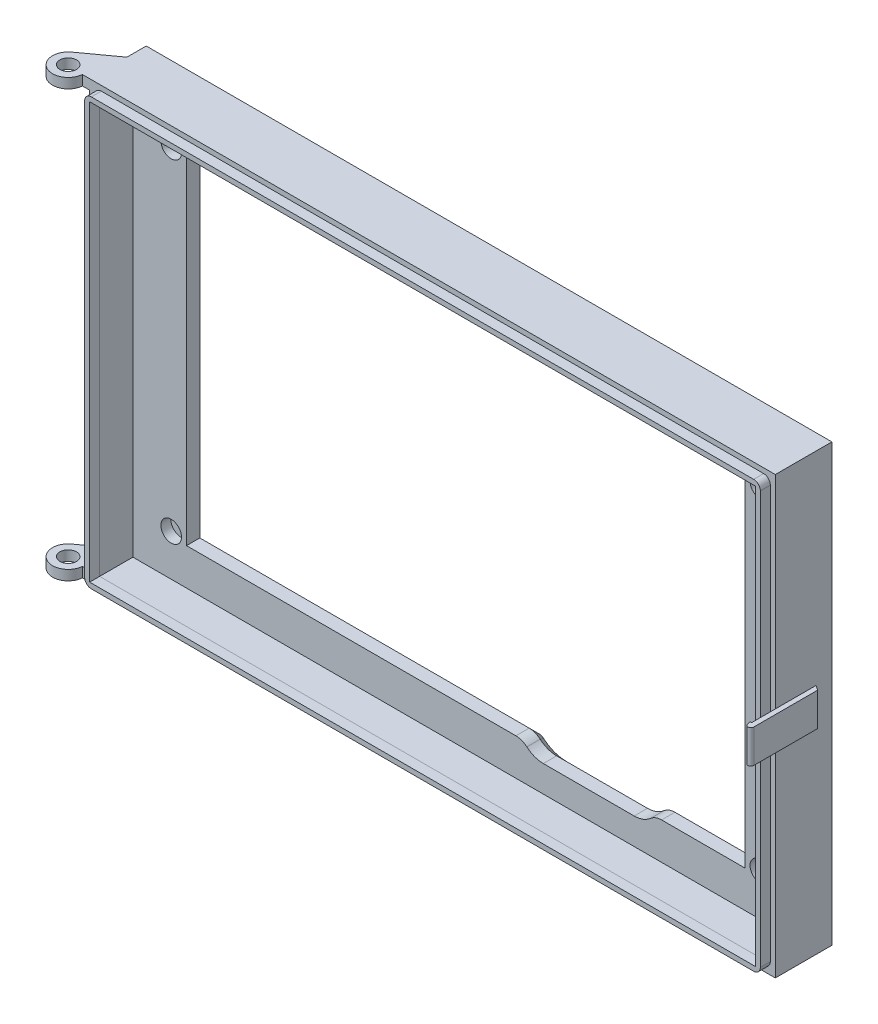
ISO-10303-21;
HEADER;
FILE_DESCRIPTION(('STEP AP214'),'2;1');
FILE_NAME('part.step','',(''),(''),'','','');
FILE_SCHEMA(('AUTOMOTIVE_DESIGN { 1 0 10303 214 1 1 1 1 }'));
ENDSEC;
DATA;
#1=APPLICATION_CONTEXT('core data for automotive mechanical design processes');
#2=APPLICATION_PROTOCOL_DEFINITION('international standard','automotive_design',2000,#1);
#3=PRODUCT_CONTEXT('',#1,'mechanical');
#4=PRODUCT('Part','Part','',(#3));
#5=PRODUCT_RELATED_PRODUCT_CATEGORY('part','',(#4));
#6=PRODUCT_DEFINITION_FORMATION('','',#4);
#7=PRODUCT_DEFINITION_CONTEXT('part definition',#1,'design');
#8=PRODUCT_DEFINITION('design','',#6,#7);
#9=PRODUCT_DEFINITION_SHAPE('','',#8);
#10=(LENGTH_UNIT() NAMED_UNIT(*) SI_UNIT(.MILLI.,.METRE.));
#11=(NAMED_UNIT(*) PLANE_ANGLE_UNIT() SI_UNIT($,.RADIAN.));
#12=(NAMED_UNIT(*) SI_UNIT($,.STERADIAN.) SOLID_ANGLE_UNIT());
#13=UNCERTAINTY_MEASURE_WITH_UNIT(LENGTH_MEASURE(1.E-05),#10,'distance_accuracy_value','');
#14=(GEOMETRIC_REPRESENTATION_CONTEXT(3) GLOBAL_UNCERTAINTY_ASSIGNED_CONTEXT((#13)) GLOBAL_UNIT_ASSIGNED_CONTEXT((#10,
#11,#12)) REPRESENTATION_CONTEXT('',''));
#15=CARTESIAN_POINT('',(0.,0.,0.));
#16=DIRECTION('',(0.,0.,1.));
#17=DIRECTION('',(1.,0.,0.));
#18=AXIS2_PLACEMENT_3D('',#15,#16,#17);
#19=CARTESIAN_POINT('',(0.,1.5,20.));
#20=DIRECTION('',(0.,-1.,0.));
#21=DIRECTION('',(0.,0.,-1.));
#22=AXIS2_PLACEMENT_3D('',#19,#20,#21);
#23=PLANE('',#22);
#24=DIRECTION('',(-1.,0.,0.));
#25=VECTOR('',#24,1.);
#26=CARTESIAN_POINT('',(0.,1.5,17.));
#27=LINE('',#26,#25);
#28=CARTESIAN_POINT('',(118.289473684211,1.5,17.));
#29=VERTEX_POINT('',#28);
#30=CARTESIAN_POINT('',(-80.7105263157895,1.5,17.));
#31=VERTEX_POINT('',#30);
#32=EDGE_CURVE('E185',#29,#31,#27,.T.);
#33=ORIENTED_EDGE('',*,*,#32,.F.);
#34=DIRECTION('',(0.,0.,-1.));
#35=VECTOR('',#34,1.);
#36=CARTESIAN_POINT('',(118.289473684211,1.5,20.));
#37=LINE('',#36,#35);
#38=CARTESIAN_POINT('',(118.289473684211,1.5,20.));
#39=VERTEX_POINT('',#38);
#40=EDGE_CURVE('E227',#29,#39,#37,.F.);
#41=ORIENTED_EDGE('',*,*,#40,.T.);
#42=DIRECTION('',(-1.,0.,0.));
#43=VECTOR('',#42,1.);
#44=CARTESIAN_POINT('',(0.,1.5,20.));
#45=LINE('',#44,#43);
#46=CARTESIAN_POINT('',(-80.7105263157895,1.5,20.));
#47=VERTEX_POINT('',#46);
#48=EDGE_CURVE('E189',#39,#47,#45,.T.);
#49=ORIENTED_EDGE('',*,*,#48,.T.);
#50=DIRECTION('',(0.,0.,-1.));
#51=VECTOR('',#50,1.);
#52=CARTESIAN_POINT('',(-80.7105263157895,1.5,20.));
#53=LINE('',#52,#51);
#54=EDGE_CURVE('E224',#47,#31,#53,.T.);
#55=ORIENTED_EDGE('',*,*,#54,.T.);
#56=EDGE_LOOP('',(#33,#41,#49,#55));
#57=FACE_BOUND('',#56,.T.);
#58=ADVANCED_FACE('F57',(#57),#23,.T.);
#59=CARTESIAN_POINT('',(120.289473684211,0.,20.));
#60=DIRECTION('',(1.,0.,0.));
#61=DIRECTION('',(0.,1.,0.));
#62=AXIS2_PLACEMENT_3D('',#59,#60,#61);
#63=PLANE('',#62);
#64=DIRECTION('',(0.,-1.,0.));
#65=VECTOR('',#64,1.);
#66=CARTESIAN_POINT('',(120.289473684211,0.,20.));
#67=LINE('',#66,#65);
#68=CARTESIAN_POINT('',(120.28947368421,127.5,20.));
#69=VERTEX_POINT('',#68);
#70=CARTESIAN_POINT('',(120.289473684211,3.5,20.));
#71=VERTEX_POINT('',#70);
#72=EDGE_CURVE('E198',#69,#71,#67,.T.);
#73=ORIENTED_EDGE('',*,*,#72,.T.);
#74=DIRECTION('',(0.,0.,-1.));
#75=VECTOR('',#74,1.);
#76=CARTESIAN_POINT('',(120.289473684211,3.5,20.));
#77=LINE('',#76,#75);
#78=CARTESIAN_POINT('',(120.289473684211,3.5,17.));
#79=VERTEX_POINT('',#78);
#80=EDGE_CURVE('E213',#71,#79,#77,.T.);
#81=ORIENTED_EDGE('',*,*,#80,.T.);
#82=DIRECTION('',(0.,-1.,0.));
#83=VECTOR('',#82,1.);
#84=CARTESIAN_POINT('',(120.289473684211,0.,17.));
#85=LINE('',#84,#83);
#86=CARTESIAN_POINT('',(120.28947368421,127.5,17.));
#87=VERTEX_POINT('',#86);
#88=EDGE_CURVE('E193',#87,#79,#85,.T.);
#89=ORIENTED_EDGE('',*,*,#88,.F.);
#90=DIRECTION('',(0.,0.,-1.));
#91=VECTOR('',#90,1.);
#92=CARTESIAN_POINT('',(120.28947368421,127.5,20.));
#93=LINE('',#92,#91);
#94=EDGE_CURVE('E201',#87,#69,#93,.F.);
#95=ORIENTED_EDGE('',*,*,#94,.T.);
#96=EDGE_LOOP('',(#73,#81,#89,#95));
#97=FACE_BOUND('',#96,.T.);
#98=ADVANCED_FACE('F262',(#97),#63,.T.);
#99=CARTESIAN_POINT('',(0.,129.5,20.));
#100=DIRECTION('',(0.,1.,0.));
#101=DIRECTION('',(0.,0.,1.));
#102=AXIS2_PLACEMENT_3D('',#99,#100,#101);
#103=PLANE('',#102);
#104=DIRECTION('',(1.,0.,0.));
#105=VECTOR('',#104,1.);
#106=CARTESIAN_POINT('',(0.,129.5,20.));
#107=LINE('',#106,#105);
#108=CARTESIAN_POINT('',(-80.7105263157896,129.5,20.));
#109=VERTEX_POINT('',#108);
#110=CARTESIAN_POINT('',(118.28947368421,129.5,20.));
#111=VERTEX_POINT('',#110);
#112=EDGE_CURVE('E195',#109,#111,#107,.T.);
#113=ORIENTED_EDGE('',*,*,#112,.T.);
#114=DIRECTION('',(0.,0.,-1.));
#115=VECTOR('',#114,1.);
#116=CARTESIAN_POINT('',(118.28947368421,129.5,20.));
#117=LINE('',#116,#115);
#118=CARTESIAN_POINT('',(118.28947368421,129.5,17.));
#119=VERTEX_POINT('',#118);
#120=EDGE_CURVE('E238',#111,#119,#117,.T.);
#121=ORIENTED_EDGE('',*,*,#120,.T.);
#122=DIRECTION('',(1.,0.,0.));
#123=VECTOR('',#122,1.);
#124=CARTESIAN_POINT('',(0.,129.5,17.));
#125=LINE('',#124,#123);
#126=CARTESIAN_POINT('',(-80.7105263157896,129.5,17.));
#127=VERTEX_POINT('',#126);
#128=EDGE_CURVE('E207',#127,#119,#125,.T.);
#129=ORIENTED_EDGE('',*,*,#128,.F.);
#130=DIRECTION('',(0.,0.,-1.));
#131=VECTOR('',#130,1.);
#132=CARTESIAN_POINT('',(-80.7105263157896,129.5,20.));
#133=LINE('',#132,#131);
#134=EDGE_CURVE('E236',#127,#109,#133,.F.);
#135=ORIENTED_EDGE('',*,*,#134,.T.);
#136=EDGE_LOOP('',(#113,#121,#129,#135));
#137=FACE_BOUND('',#136,.T.);
#138=ADVANCED_FACE('F269',(#137),#103,.T.);
#139=CARTESIAN_POINT('',(-82.7105263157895,0.,20.));
#140=DIRECTION('',(-1.,0.,0.));
#141=DIRECTION('',(0.,-1.,0.));
#142=AXIS2_PLACEMENT_3D('',#139,#140,#141);
#143=PLANE('',#142);
#144=DIRECTION('',(0.,1.,0.));
#145=VECTOR('',#144,1.);
#146=CARTESIAN_POINT('',(-82.7105263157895,0.,17.));
#147=LINE('',#146,#145);
#148=CARTESIAN_POINT('',(-82.7105263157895,3.5,17.));
#149=VERTEX_POINT('',#148);
#150=CARTESIAN_POINT('',(-82.7105263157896,127.5,17.));
#151=VERTEX_POINT('',#150);
#152=EDGE_CURVE('E204',#149,#151,#147,.T.);
#153=ORIENTED_EDGE('',*,*,#152,.F.);
#154=DIRECTION('',(0.,0.,-1.));
#155=VECTOR('',#154,1.);
#156=CARTESIAN_POINT('',(-82.7105263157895,3.5,20.));
#157=LINE('',#156,#155);
#158=CARTESIAN_POINT('',(-82.7105263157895,3.5,20.));
#159=VERTEX_POINT('',#158);
#160=EDGE_CURVE('E12',#149,#159,#157,.F.);
#161=ORIENTED_EDGE('',*,*,#160,.T.);
#162=DIRECTION('',(0.,1.,0.));
#163=VECTOR('',#162,1.);
#164=CARTESIAN_POINT('',(-82.7105263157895,0.,20.));
#165=LINE('',#164,#163);
#166=CARTESIAN_POINT('',(-82.7105263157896,127.5,20.));
#167=VERTEX_POINT('',#166);
#168=EDGE_CURVE('E192',#159,#167,#165,.T.);
#169=ORIENTED_EDGE('',*,*,#168,.T.);
#170=DIRECTION('',(0.,0.,-1.));
#171=VECTOR('',#170,1.);
#172=CARTESIAN_POINT('',(-82.7105263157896,127.5,20.));
#173=LINE('',#172,#171);
#174=EDGE_CURVE('E65',#167,#151,#173,.T.);
#175=ORIENTED_EDGE('',*,*,#174,.T.);
#176=EDGE_LOOP('',(#153,#161,#169,#175));
#177=FACE_BOUND('',#176,.T.);
#178=ADVANCED_FACE('F242',(#177),#143,.T.);
#179=CARTESIAN_POINT('',(0.,0.,20.));
#180=DIRECTION('',(0.,0.,-1.));
#181=DIRECTION('',(-1.,0.,0.));
#182=AXIS2_PLACEMENT_3D('',#179,#180,#181);
#183=PLANE('',#182);
#184=DIRECTION('',(0.,-1.,0.));
#185=VECTOR('',#184,1.);
#186=CARTESIAN_POINT('',(118.78947368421,0.,20.));
#187=LINE('',#186,#185);
#188=CARTESIAN_POINT('',(118.78947368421,128.,20.));
#189=VERTEX_POINT('',#188);
#190=CARTESIAN_POINT('',(118.78947368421,3.,20.));
#191=VERTEX_POINT('',#190);
#192=EDGE_CURVE('E158',#189,#191,#187,.T.);
#193=ORIENTED_EDGE('',*,*,#192,.T.);
#194=DIRECTION('',(-1.,0.,0.));
#195=VECTOR('',#194,1.);
#196=CARTESIAN_POINT('',(0.,3.,20.));
#197=LINE('',#196,#195);
#198=CARTESIAN_POINT('',(-81.2105263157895,3.,20.));
#199=VERTEX_POINT('',#198);
#200=EDGE_CURVE('E150',#191,#199,#197,.T.);
#201=ORIENTED_EDGE('',*,*,#200,.T.);
#202=DIRECTION('',(0.,1.,0.));
#203=VECTOR('',#202,1.);
#204=CARTESIAN_POINT('',(-81.2105263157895,0.,20.));
#205=LINE('',#204,#203);
#206=CARTESIAN_POINT('',(-81.2105263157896,128.,20.));
#207=VERTEX_POINT('',#206);
#208=EDGE_CURVE('E162',#199,#207,#205,.T.);
#209=ORIENTED_EDGE('',*,*,#208,.T.);
#210=DIRECTION('',(1.,0.,0.));
#211=VECTOR('',#210,1.);
#212=CARTESIAN_POINT('',(0.,128.,20.));
#213=LINE('',#212,#211);
#214=EDGE_CURVE('E166',#207,#189,#213,.T.);
#215=ORIENTED_EDGE('',*,*,#214,.T.);
#216=EDGE_LOOP('',(#193,#201,#209,#215));
#217=FACE_BOUND('',#216,.T.);
#218=ORIENTED_EDGE('',*,*,#48,.F.);
#219=CARTESIAN_POINT('',(118.289473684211,3.5,20.));
#220=DIRECTION('',(0.,0.,-1.));
#221=DIRECTION('',(-1.,0.,0.));
#222=AXIS2_PLACEMENT_3D('',#219,#220,#221);
#223=CIRCLE('',#222,2.);
#224=EDGE_CURVE('E234',#39,#71,#223,.F.);
#225=ORIENTED_EDGE('',*,*,#224,.T.);
#226=ORIENTED_EDGE('',*,*,#72,.F.);
#227=CARTESIAN_POINT('',(118.28947368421,127.5,20.));
#228=DIRECTION('',(0.,0.,-1.));
#229=DIRECTION('',(-1.,0.,0.));
#230=AXIS2_PLACEMENT_3D('',#227,#228,#229);
#231=CIRCLE('',#230,2.);
#232=EDGE_CURVE('E232',#69,#111,#231,.F.);
#233=ORIENTED_EDGE('',*,*,#232,.T.);
#234=ORIENTED_EDGE('',*,*,#112,.F.);
#235=CARTESIAN_POINT('',(-80.7105263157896,127.5,20.));
#236=DIRECTION('',(0.,0.,-1.));
#237=DIRECTION('',(-1.,0.,0.));
#238=AXIS2_PLACEMENT_3D('',#235,#236,#237);
#239=CIRCLE('',#238,2.);
#240=EDGE_CURVE('E72',#109,#167,#239,.F.);
#241=ORIENTED_EDGE('',*,*,#240,.T.);
#242=ORIENTED_EDGE('',*,*,#168,.F.);
#243=CARTESIAN_POINT('',(-80.7105263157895,3.5,20.));
#244=DIRECTION('',(0.,0.,-1.));
#245=DIRECTION('',(-1.,0.,0.));
#246=AXIS2_PLACEMENT_3D('',#243,#244,#245);
#247=CIRCLE('',#246,2.);
#248=EDGE_CURVE('E230',#159,#47,#247,.F.);
#249=ORIENTED_EDGE('',*,*,#248,.T.);
#250=EDGE_LOOP('',(#218,#225,#226,#233,#234,#241,#242,#249));
#251=FACE_BOUND('',#250,.T.);
#252=ADVANCED_FACE('F168',(#217,#251),#183,.F.);
#253=CARTESIAN_POINT('',(0.,0.,17.));
#254=DIRECTION('',(0.,0.,-1.));
#255=DIRECTION('',(-1.,0.,0.));
#256=AXIS2_PLACEMENT_3D('',#253,#254,#255);
#257=PLANE('',#256);
#258=DIRECTION('',(-1.,0.,0.));
#259=VECTOR('',#258,1.);
#260=CARTESIAN_POINT('',(0.,3.,17.));
#261=LINE('',#260,#259);
#262=CARTESIAN_POINT('',(118.78947368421,3.,17.));
#263=VERTEX_POINT('',#262);
#264=CARTESIAN_POINT('',(-81.2105263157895,3.,17.));
#265=VERTEX_POINT('',#264);
#266=EDGE_CURVE('E153',#263,#265,#261,.T.);
#267=ORIENTED_EDGE('',*,*,#266,.F.);
#268=DIRECTION('',(0.,-1.,0.));
#269=VECTOR('',#268,1.);
#270=CARTESIAN_POINT('',(118.78947368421,0.,17.));
#271=LINE('',#270,#269);
#272=CARTESIAN_POINT('',(118.78947368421,128.,17.));
#273=VERTEX_POINT('',#272);
#274=EDGE_CURVE('E170',#273,#263,#271,.T.);
#275=ORIENTED_EDGE('',*,*,#274,.F.);
#276=DIRECTION('',(1.,0.,0.));
#277=VECTOR('',#276,1.);
#278=CARTESIAN_POINT('',(0.,128.,17.));
#279=LINE('',#278,#277);
#280=CARTESIAN_POINT('',(-81.2105263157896,128.,17.));
#281=VERTEX_POINT('',#280);
#282=EDGE_CURVE('E173',#281,#273,#279,.T.);
#283=ORIENTED_EDGE('',*,*,#282,.F.);
#284=DIRECTION('',(0.,1.,0.));
#285=VECTOR('',#284,1.);
#286=CARTESIAN_POINT('',(-81.2105263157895,0.,17.));
#287=LINE('',#286,#285);
#288=EDGE_CURVE('E179',#265,#281,#287,.T.);
#289=ORIENTED_EDGE('',*,*,#288,.F.);
#290=EDGE_LOOP('',(#267,#275,#283,#289));
#291=FACE_BOUND('',#290,.T.);
#292=ORIENTED_EDGE('',*,*,#88,.T.);
#293=CARTESIAN_POINT('',(118.289473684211,3.5,17.));
#294=DIRECTION('',(0.,0.,-1.));
#295=DIRECTION('',(-1.,0.,0.));
#296=AXIS2_PLACEMENT_3D('',#293,#294,#295);
#297=CIRCLE('',#296,2.);
#298=EDGE_CURVE('E222',#79,#29,#297,.T.);
#299=ORIENTED_EDGE('',*,*,#298,.T.);
#300=ORIENTED_EDGE('',*,*,#32,.T.);
#301=CARTESIAN_POINT('',(-80.7105263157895,3.5,17.));
#302=DIRECTION('',(0.,0.,-1.));
#303=DIRECTION('',(-1.,0.,0.));
#304=AXIS2_PLACEMENT_3D('',#301,#302,#303);
#305=CIRCLE('',#304,2.);
#306=EDGE_CURVE('E218',#31,#149,#305,.T.);
#307=ORIENTED_EDGE('',*,*,#306,.T.);
#308=ORIENTED_EDGE('',*,*,#152,.T.);
#309=CARTESIAN_POINT('',(-80.7105263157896,127.5,17.));
#310=DIRECTION('',(0.,0.,-1.));
#311=DIRECTION('',(-1.,0.,0.));
#312=AXIS2_PLACEMENT_3D('',#309,#310,#311);
#313=CIRCLE('',#312,2.);
#314=EDGE_CURVE('E216',#151,#127,#313,.T.);
#315=ORIENTED_EDGE('',*,*,#314,.T.);
#316=ORIENTED_EDGE('',*,*,#128,.T.);
#317=CARTESIAN_POINT('',(118.28947368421,127.5,17.));
#318=DIRECTION('',(0.,0.,-1.));
#319=DIRECTION('',(-1.,0.,0.));
#320=AXIS2_PLACEMENT_3D('',#317,#318,#319);
#321=CIRCLE('',#320,2.);
#322=EDGE_CURVE('E220',#119,#87,#321,.T.);
#323=ORIENTED_EDGE('',*,*,#322,.T.);
#324=EDGE_LOOP('',(#292,#299,#300,#307,#308,#315,#316,#323));
#325=FACE_BOUND('',#324,.T.);
#326=ADVANCED_FACE('F245',(#291,#325),#257,.T.);
#327=CARTESIAN_POINT('',(0.,3.,20.));
#328=DIRECTION('',(0.,-1.,0.));
#329=DIRECTION('',(0.,0.,-1.));
#330=AXIS2_PLACEMENT_3D('',#327,#328,#329);
#331=PLANE('',#330);
#332=ORIENTED_EDGE('',*,*,#266,.T.);
#333=DIRECTION('',(0.,0.,-1.));
#334=VECTOR('',#333,1.);
#335=CARTESIAN_POINT('',(-81.2105263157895,3.,20.));
#336=LINE('',#335,#334);
#337=EDGE_CURVE('E146',#199,#265,#336,.T.);
#338=ORIENTED_EDGE('',*,*,#337,.F.);
#339=ORIENTED_EDGE('',*,*,#200,.F.);
#340=DIRECTION('',(0.,0.,-1.));
#341=VECTOR('',#340,1.);
#342=CARTESIAN_POINT('',(118.78947368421,3.,20.));
#343=LINE('',#342,#341);
#344=EDGE_CURVE('E183',#191,#263,#343,.T.);
#345=ORIENTED_EDGE('',*,*,#344,.T.);
#346=EDGE_LOOP('',(#332,#338,#339,#345));
#347=FACE_BOUND('',#346,.T.);
#348=ADVANCED_FACE('F148',(#347),#331,.F.);
#349=CARTESIAN_POINT('',(118.78947368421,0.,20.));
#350=DIRECTION('',(1.,0.,0.));
#351=DIRECTION('',(0.,1.,0.));
#352=AXIS2_PLACEMENT_3D('',#349,#350,#351);
#353=PLANE('',#352);
#354=ORIENTED_EDGE('',*,*,#274,.T.);
#355=ORIENTED_EDGE('',*,*,#344,.F.);
#356=ORIENTED_EDGE('',*,*,#192,.F.);
#357=DIRECTION('',(0.,0.,-1.));
#358=VECTOR('',#357,1.);
#359=CARTESIAN_POINT('',(118.78947368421,128.,20.));
#360=LINE('',#359,#358);
#361=EDGE_CURVE('E186',#189,#273,#360,.T.);
#362=ORIENTED_EDGE('',*,*,#361,.T.);
#363=EDGE_LOOP('',(#354,#355,#356,#362));
#364=FACE_BOUND('',#363,.T.);
#365=ADVANCED_FACE('F323',(#364),#353,.F.);
#366=CARTESIAN_POINT('',(0.,128.,20.));
#367=DIRECTION('',(0.,1.,0.));
#368=DIRECTION('',(0.,0.,1.));
#369=AXIS2_PLACEMENT_3D('',#366,#367,#368);
#370=PLANE('',#369);
#371=ORIENTED_EDGE('',*,*,#282,.T.);
#372=ORIENTED_EDGE('',*,*,#361,.F.);
#373=ORIENTED_EDGE('',*,*,#214,.F.);
#374=DIRECTION('',(0.,0.,-1.));
#375=VECTOR('',#374,1.);
#376=CARTESIAN_POINT('',(-81.2105263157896,128.,20.));
#377=LINE('',#376,#375);
#378=EDGE_CURVE('E157',#207,#281,#377,.T.);
#379=ORIENTED_EDGE('',*,*,#378,.T.);
#380=EDGE_LOOP('',(#371,#372,#373,#379));
#381=FACE_BOUND('',#380,.T.);
#382=ADVANCED_FACE('F315',(#381),#370,.F.);
#383=CARTESIAN_POINT('',(-81.2105263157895,0.,20.));
#384=DIRECTION('',(-1.,0.,0.));
#385=DIRECTION('',(0.,-1.,0.));
#386=AXIS2_PLACEMENT_3D('',#383,#384,#385);
#387=PLANE('',#386);
#388=ORIENTED_EDGE('',*,*,#288,.T.);
#389=ORIENTED_EDGE('',*,*,#378,.F.);
#390=ORIENTED_EDGE('',*,*,#208,.F.);
#391=ORIENTED_EDGE('',*,*,#337,.T.);
#392=EDGE_LOOP('',(#388,#389,#390,#391));
#393=FACE_BOUND('',#392,.T.);
#394=ADVANCED_FACE('F163',(#393),#387,.F.);
#395=CARTESIAN_POINT('',(118.289473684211,3.5,20.));
#396=DIRECTION('',(0.,0.,-1.));
#397=DIRECTION('',(-1.,0.,0.));
#398=AXIS2_PLACEMENT_3D('',#395,#396,#397);
#399=CYLINDRICAL_SURFACE('',#398,2.);
#400=ORIENTED_EDGE('',*,*,#224,.F.);
#401=ORIENTED_EDGE('',*,*,#40,.F.);
#402=ORIENTED_EDGE('',*,*,#298,.F.);
#403=ORIENTED_EDGE('',*,*,#80,.F.);
#404=EDGE_LOOP('',(#400,#401,#402,#403));
#405=FACE_BOUND('',#404,.T.);
#406=ADVANCED_FACE('F259',(#405),#399,.T.);
#407=CARTESIAN_POINT('',(118.28947368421,127.5,20.));
#408=DIRECTION('',(0.,0.,-1.));
#409=DIRECTION('',(-1.,0.,0.));
#410=AXIS2_PLACEMENT_3D('',#407,#408,#409);
#411=CYLINDRICAL_SURFACE('',#410,2.);
#412=ORIENTED_EDGE('',*,*,#232,.F.);
#413=ORIENTED_EDGE('',*,*,#94,.F.);
#414=ORIENTED_EDGE('',*,*,#322,.F.);
#415=ORIENTED_EDGE('',*,*,#120,.F.);
#416=EDGE_LOOP('',(#412,#413,#414,#415));
#417=FACE_BOUND('',#416,.T.);
#418=ADVANCED_FACE('F267',(#417),#411,.T.);
#419=CARTESIAN_POINT('',(-80.7105263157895,3.5,20.));
#420=DIRECTION('',(0.,0.,-1.));
#421=DIRECTION('',(-1.,0.,0.));
#422=AXIS2_PLACEMENT_3D('',#419,#420,#421);
#423=CYLINDRICAL_SURFACE('',#422,2.);
#424=ORIENTED_EDGE('',*,*,#248,.F.);
#425=ORIENTED_EDGE('',*,*,#160,.F.);
#426=ORIENTED_EDGE('',*,*,#306,.F.);
#427=ORIENTED_EDGE('',*,*,#54,.F.);
#428=EDGE_LOOP('',(#424,#425,#426,#427));
#429=FACE_BOUND('',#428,.T.);
#430=ADVANCED_FACE('F251',(#429),#423,.T.);
#431=CARTESIAN_POINT('',(-80.7105263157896,127.5,20.));
#432=DIRECTION('',(0.,0.,-1.));
#433=DIRECTION('',(-1.,0.,0.));
#434=AXIS2_PLACEMENT_3D('',#431,#432,#433);
#435=CYLINDRICAL_SURFACE('',#434,2.);
#436=ORIENTED_EDGE('',*,*,#240,.F.);
#437=ORIENTED_EDGE('',*,*,#134,.F.);
#438=ORIENTED_EDGE('',*,*,#314,.F.);
#439=ORIENTED_EDGE('',*,*,#174,.F.);
#440=EDGE_LOOP('',(#436,#437,#438,#439));
#441=FACE_BOUND('',#440,.T.);
#442=ADVANCED_FACE('F59',(#441),#435,.T.);
#443=CLOSED_SHELL('',(#58,#98,#138,#178,#252,#326,#348,#365,#382,#394,#406,#418,#430,#442));
#444=MANIFOLD_SOLID_BREP('B2',#443);
#445=CARTESIAN_POINT('',(-84.2105263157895,0.,7.));
#446=DIRECTION('',(1.,0.,0.));
#447=DIRECTION('',(0.,1.,0.));
#448=AXIS2_PLACEMENT_3D('',#445,#446,#447);
#449=PLANE('',#448);
#450=DIRECTION('',(0.,-1.,0.));
#451=VECTOR('',#450,1.);
#452=CARTESIAN_POINT('',(-84.2105263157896,3.,5.80639149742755));
#453=LINE('',#452,#451);
#454=CARTESIAN_POINT('',(-84.2105263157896,3.,5.80639149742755));
#455=VERTEX_POINT('',#454);
#456=CARTESIAN_POINT('',(-84.2105263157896,0.,5.80639149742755));
#457=VERTEX_POINT('',#456);
#458=EDGE_CURVE('E662',#455,#457,#453,.T.);
#459=ORIENTED_EDGE('',*,*,#458,.F.);
#460=DIRECTION('',(0.,0.,-1.));
#461=VECTOR('',#460,1.);
#462=CARTESIAN_POINT('',(-84.2105263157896,3.,5.80639149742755));
#463=LINE('',#462,#461);
#464=CARTESIAN_POINT('',(-84.2105263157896,3.,17.0000000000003));
#465=VERTEX_POINT('',#464);
#466=EDGE_CURVE('E645',#465,#455,#463,.T.);
#467=ORIENTED_EDGE('',*,*,#466,.F.);
#468=DIRECTION('',(0.,-1.,0.));
#469=VECTOR('',#468,1.);
#470=CARTESIAN_POINT('',(-84.2105263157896,131.,17.));
#471=LINE('',#470,#469);
#472=CARTESIAN_POINT('',(-84.2105263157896,128.,17.0000000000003));
#473=VERTEX_POINT('',#472);
#474=EDGE_CURVE('E642',#473,#465,#471,.T.);
#475=ORIENTED_EDGE('',*,*,#474,.F.);
#476=DIRECTION('',(0.,0.,-1.));
#477=VECTOR('',#476,1.);
#478=CARTESIAN_POINT('',(-84.2105263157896,128.,17.0000000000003));
#479=LINE('',#478,#477);
#480=CARTESIAN_POINT('',(-84.2105263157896,128.,5.80639149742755));
#481=VERTEX_POINT('',#480);
#482=EDGE_CURVE('E731',#473,#481,#479,.T.);
#483=ORIENTED_EDGE('',*,*,#482,.T.);
#484=DIRECTION('',(0.,1.,0.));
#485=VECTOR('',#484,1.);
#486=CARTESIAN_POINT('',(-84.2105263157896,128.,5.80639149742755));
#487=LINE('',#486,#485);
#488=CARTESIAN_POINT('',(-84.2105263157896,131.,5.80639149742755));
#489=VERTEX_POINT('',#488);
#490=EDGE_CURVE('E744',#481,#489,#487,.T.);
#491=ORIENTED_EDGE('',*,*,#490,.T.);
#492=DIRECTION('',(0.,0.,-1.));
#493=VECTOR('',#492,1.);
#494=CARTESIAN_POINT('',(-84.2105263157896,131.,7.));
#495=LINE('',#494,#493);
#496=CARTESIAN_POINT('',(-84.2105263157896,131.,0.));
#497=VERTEX_POINT('',#496);
#498=EDGE_CURVE('E858',#489,#497,#495,.T.);
#499=ORIENTED_EDGE('',*,*,#498,.T.);
#500=DIRECTION('',(0.,-1.,0.));
#501=VECTOR('',#500,1.);
#502=CARTESIAN_POINT('',(-84.2105263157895,0.,0.));
#503=LINE('',#502,#501);
#504=CARTESIAN_POINT('',(-84.2105263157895,0.,0.));
#505=VERTEX_POINT('',#504);
#506=EDGE_CURVE('E848',#497,#505,#503,.T.);
#507=ORIENTED_EDGE('',*,*,#506,.T.);
#508=DIRECTION('',(0.,0.,-1.));
#509=VECTOR('',#508,1.);
#510=CARTESIAN_POINT('',(-84.2105263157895,0.,7.));
#511=LINE('',#510,#509);
#512=EDGE_CURVE('E866',#457,#505,#511,.T.);
#513=ORIENTED_EDGE('',*,*,#512,.F.);
#514=EDGE_LOOP('',(#459,#467,#475,#483,#491,#499,#507,#513));
#515=FACE_BOUND('',#514,.T.);
#516=ADVANCED_FACE('F391',(#515),#449,.F.);
#517=CARTESIAN_POINT('',(-84.2105263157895,0.,7.));
#518=DIRECTION('',(0.,1.,0.));
#519=DIRECTION('',(0.,0.,1.));
#520=AXIS2_PLACEMENT_3D('',#517,#518,#519);
#521=PLANE('',#520);
#522=DIRECTION('',(1.,0.,0.));
#523=VECTOR('',#522,1.);
#524=CARTESIAN_POINT('',(-84.2105263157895,0.,0.));
#525=LINE('',#524,#523);
#526=CARTESIAN_POINT('',(121.78947368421,0.,0.));
#527=VERTEX_POINT('',#526);
#528=EDGE_CURVE('E851',#505,#527,#525,.T.);
#529=ORIENTED_EDGE('',*,*,#528,.T.);
#530=DIRECTION('',(0.,0.,-1.));
#531=VECTOR('',#530,1.);
#532=CARTESIAN_POINT('',(121.78947368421,0.,7.));
#533=LINE('',#532,#531);
#534=CARTESIAN_POINT('',(121.78947368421,0.,17.));
#535=VERTEX_POINT('',#534);
#536=EDGE_CURVE('E863',#535,#527,#533,.T.);
#537=ORIENTED_EDGE('',*,*,#536,.F.);
#538=DIRECTION('',(1.,0.,0.));
#539=VECTOR('',#538,1.);
#540=CARTESIAN_POINT('',(-84.2105263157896,0.,17.));
#541=LINE('',#540,#539);
#542=CARTESIAN_POINT('',(-86.3906066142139,0.,17.0000000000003));
#543=VERTEX_POINT('',#542);
#544=EDGE_CURVE('E779',#543,#535,#541,.T.);
#545=ORIENTED_EDGE('',*,*,#544,.F.);
#546=CARTESIAN_POINT('',(-91.072359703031,0.,16.5862512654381));
#547=DIRECTION('',(0.,1.,0.));
#548=DIRECTION('',(0.,0.,1.));
#549=AXIS2_PLACEMENT_3D('',#546,#547,#548);
#550=CIRCLE('',#549,4.7);
#551=CARTESIAN_POINT('',(-93.67136877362,0.,12.6702390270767));
#552=VERTEX_POINT('',#551);
#553=EDGE_CURVE('E660',#552,#543,#550,.T.);
#554=ORIENTED_EDGE('',*,*,#553,.F.);
#555=DIRECTION('',(-0.809417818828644,0.,0.587233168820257));
#556=VECTOR('',#555,1.);
#557=CARTESIAN_POINT('',(-84.2105263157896,0.,5.80639149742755));
#558=LINE('',#557,#556);
#559=EDGE_CURVE('E656',#457,#552,#558,.T.);
#560=ORIENTED_EDGE('',*,*,#559,.F.);
#561=ORIENTED_EDGE('',*,*,#512,.T.);
#562=EDGE_LOOP('',(#529,#537,#545,#554,#560,#561));
#563=FACE_BOUND('',#562,.T.);
#564=CARTESIAN_POINT('',(-91.072359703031,0.,16.5862512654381));
#565=DIRECTION('',(0.,1.,0.));
#566=DIRECTION('',(0.,0.,1.));
#567=AXIS2_PLACEMENT_3D('',#564,#565,#566);
#568=CIRCLE('',#567,2.50000000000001);
#569=CARTESIAN_POINT('',(-91.072359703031,0.,19.0862512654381));
#570=VERTEX_POINT('',#569);
#571=EDGE_CURVE('E1602',#570,#570,#568,.T.);
#572=ORIENTED_EDGE('',*,*,#571,.T.);
#573=EDGE_LOOP('',(#572));
#574=FACE_BOUND('',#573,.T.);
#575=ADVANCED_FACE('F1043',(#563,#574),#521,.F.);
#576=CARTESIAN_POINT('',(121.78947368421,0.,7.));
#577=DIRECTION('',(-1.,0.,0.));
#578=DIRECTION('',(0.,-1.,0.));
#579=AXIS2_PLACEMENT_3D('',#576,#577,#578);
#580=PLANE('',#579);
#581=DIRECTION('',(0.,1.,0.));
#582=VECTOR('',#581,1.);
#583=CARTESIAN_POINT('',(121.78947368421,131.,17.));
#584=LINE('',#583,#582);
#585=CARTESIAN_POINT('',(121.78947368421,70.,17.));
#586=VERTEX_POINT('',#585);
#587=CARTESIAN_POINT('',(121.78947368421,131.,17.));
#588=VERTEX_POINT('',#587);
#589=EDGE_CURVE('E781',#586,#588,#584,.T.);
#590=ORIENTED_EDGE('',*,*,#589,.F.);
#591=DIRECTION('',(0.,0.,1.));
#592=VECTOR('',#591,1.);
#593=CARTESIAN_POINT('',(121.78947368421,70.,4.73578349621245));
#594=LINE('',#593,#592);
#595=CARTESIAN_POINT('',(121.78947368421,70.,4.73578349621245));
#596=VERTEX_POINT('',#595);
#597=EDGE_CURVE('E409',#596,#586,#594,.T.);
#598=ORIENTED_EDGE('',*,*,#597,.F.);
#599=DIRECTION('',(0.,-1.,0.));
#600=VECTOR('',#599,1.);
#601=CARTESIAN_POINT('',(121.78947368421,70.,4.73578349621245));
#602=LINE('',#601,#600);
#603=CARTESIAN_POINT('',(121.78947368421,60.,4.73578349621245));
#604=VERTEX_POINT('',#603);
#605=EDGE_CURVE('E683',#596,#604,#602,.T.);
#606=ORIENTED_EDGE('',*,*,#605,.T.);
#607=DIRECTION('',(0.,0.,1.));
#608=VECTOR('',#607,1.);
#609=CARTESIAN_POINT('',(121.78947368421,60.,17.));
#610=LINE('',#609,#608);
#611=CARTESIAN_POINT('',(121.78947368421,60.,17.));
#612=VERTEX_POINT('',#611);
#613=EDGE_CURVE('E664',#604,#612,#610,.T.);
#614=ORIENTED_EDGE('',*,*,#613,.T.);
#615=EDGE_CURVE('E782',#535,#612,#584,.T.);
#616=ORIENTED_EDGE('',*,*,#615,.F.);
#617=ORIENTED_EDGE('',*,*,#536,.T.);
#618=DIRECTION('',(0.,1.,0.));
#619=VECTOR('',#618,1.);
#620=CARTESIAN_POINT('',(121.78947368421,0.,0.));
#621=LINE('',#620,#619);
#622=CARTESIAN_POINT('',(121.78947368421,131.,0.));
#623=VERTEX_POINT('',#622);
#624=EDGE_CURVE('E853',#527,#623,#621,.T.);
#625=ORIENTED_EDGE('',*,*,#624,.T.);
#626=DIRECTION('',(0.,0.,-1.));
#627=VECTOR('',#626,1.);
#628=CARTESIAN_POINT('',(121.78947368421,131.,7.));
#629=LINE('',#628,#627);
#630=EDGE_CURVE('E860',#588,#623,#629,.T.);
#631=ORIENTED_EDGE('',*,*,#630,.F.);
#632=EDGE_LOOP('',(#590,#598,#606,#614,#616,#617,#625,#631));
#633=FACE_BOUND('',#632,.T.);
#634=ADVANCED_FACE('F1050',(#633),#580,.F.);
#635=CARTESIAN_POINT('',(-84.2105263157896,131.,7.));
#636=DIRECTION('',(0.,-1.,0.));
#637=DIRECTION('',(0.,0.,-1.));
#638=AXIS2_PLACEMENT_3D('',#635,#636,#637);
#639=PLANE('',#638);
#640=DIRECTION('',(-1.,0.,0.));
#641=VECTOR('',#640,1.);
#642=CARTESIAN_POINT('',(-84.2105263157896,131.,0.));
#643=LINE('',#642,#641);
#644=EDGE_CURVE('E855',#623,#497,#643,.T.);
#645=ORIENTED_EDGE('',*,*,#644,.T.);
#646=ORIENTED_EDGE('',*,*,#498,.F.);
#647=DIRECTION('',(-0.809417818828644,0.,0.587233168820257));
#648=VECTOR('',#647,1.);
#649=CARTESIAN_POINT('',(-84.2105263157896,131.,5.80639149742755));
#650=LINE('',#649,#648);
#651=CARTESIAN_POINT('',(-93.67136877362,131.,12.6702390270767));
#652=VERTEX_POINT('',#651);
#653=EDGE_CURVE('E417',#489,#652,#650,.T.);
#654=ORIENTED_EDGE('',*,*,#653,.T.);
#655=CARTESIAN_POINT('',(-91.072359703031,131.,16.5862512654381));
#656=DIRECTION('',(0.,1.,0.));
#657=DIRECTION('',(0.,0.,1.));
#658=AXIS2_PLACEMENT_3D('',#655,#656,#657);
#659=CIRCLE('',#658,4.7);
#660=CARTESIAN_POINT('',(-86.3906066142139,131.,17.0000000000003));
#661=VERTEX_POINT('',#660);
#662=EDGE_CURVE('E723',#652,#661,#659,.T.);
#663=ORIENTED_EDGE('',*,*,#662,.T.);
#664=DIRECTION('',(-1.,0.,0.));
#665=VECTOR('',#664,1.);
#666=CARTESIAN_POINT('',(-84.2105263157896,131.,17.));
#667=LINE('',#666,#665);
#668=EDGE_CURVE('E785',#588,#661,#667,.T.);
#669=ORIENTED_EDGE('',*,*,#668,.F.);
#670=ORIENTED_EDGE('',*,*,#630,.T.);
#671=EDGE_LOOP('',(#645,#646,#654,#663,#669,#670));
#672=FACE_BOUND('',#671,.T.);
#673=CARTESIAN_POINT('',(-91.072359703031,131.,16.5862512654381));
#674=DIRECTION('',(0.,1.,0.));
#675=DIRECTION('',(0.,0.,1.));
#676=AXIS2_PLACEMENT_3D('',#673,#674,#675);
#677=CIRCLE('',#676,2.50000000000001);
#678=CARTESIAN_POINT('',(-91.072359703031,131.,19.0862512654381));
#679=VERTEX_POINT('',#678);
#680=EDGE_CURVE('E719',#679,#679,#677,.T.);
#681=ORIENTED_EDGE('',*,*,#680,.F.);
#682=EDGE_LOOP('',(#681));
#683=FACE_BOUND('',#682,.T.);
#684=ADVANCED_FACE('F1243',(#672,#683),#639,.F.);
#685=CARTESIAN_POINT('',(0.,0.,7.));
#686=DIRECTION('',(0.,0.,-1.));
#687=DIRECTION('',(-1.,0.,0.));
#688=AXIS2_PLACEMENT_3D('',#685,#686,#687);
#689=PLANE('',#688);
#690=DIRECTION('',(-1.,0.,0.));
#691=VECTOR('',#690,1.);
#692=CARTESIAN_POINT('',(-81.2105263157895,128.,7.));
#693=LINE('',#692,#691);
#694=CARTESIAN_POINT('',(118.78947368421,128.,7.));
#695=VERTEX_POINT('',#694);
#696=CARTESIAN_POINT('',(-81.2105263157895,128.,7.));
#697=VERTEX_POINT('',#696);
#698=EDGE_CURVE('E751',#695,#697,#693,.T.);
#699=ORIENTED_EDGE('',*,*,#698,.T.);
#700=DIRECTION('',(0.,-1.,0.));
#701=VECTOR('',#700,1.);
#702=CARTESIAN_POINT('',(-81.2105263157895,128.,7.));
#703=LINE('',#702,#701);
#704=CARTESIAN_POINT('',(-81.2105263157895,3.,7.));
#705=VERTEX_POINT('',#704);
#706=EDGE_CURVE('E759',#697,#705,#703,.T.);
#707=ORIENTED_EDGE('',*,*,#706,.T.);
#708=DIRECTION('',(1.,0.,0.));
#709=VECTOR('',#708,1.);
#710=CARTESIAN_POINT('',(-81.2105263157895,3.,7.));
#711=LINE('',#710,#709);
#712=CARTESIAN_POINT('',(118.78947368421,3.,7.));
#713=VERTEX_POINT('',#712);
#714=EDGE_CURVE('E762',#705,#713,#711,.T.);
#715=ORIENTED_EDGE('',*,*,#714,.T.);
#716=DIRECTION('',(0.,1.,0.));
#717=VECTOR('',#716,1.);
#718=CARTESIAN_POINT('',(118.78947368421,128.,7.));
#719=LINE('',#718,#717);
#720=EDGE_CURVE('E765',#713,#695,#719,.T.);
#721=ORIENTED_EDGE('',*,*,#720,.T.);
#722=EDGE_LOOP('',(#699,#707,#715,#721));
#723=FACE_BOUND('',#722,.T.);
#724=CARTESIAN_POINT('',(107.28947368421,15.5,7.));
#725=DIRECTION('',(0.,0.,1.));
#726=DIRECTION('',(1.,0.,0.));
#727=AXIS2_PLACEMENT_3D('',#724,#725,#726);
#728=CIRCLE('',#727,3.09999999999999);
#729=CARTESIAN_POINT('',(110.38947368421,15.5,7.));
#730=VERTEX_POINT('',#729);
#731=EDGE_CURVE('E802',#730,#730,#728,.T.);
#732=ORIENTED_EDGE('',*,*,#731,.F.);
#733=EDGE_LOOP('',(#732));
#734=FACE_BOUND('',#733,.T.);
#735=CARTESIAN_POINT('',(-69.7105263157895,15.5,7.));
#736=DIRECTION('',(0.,0.,1.));
#737=DIRECTION('',(1.,0.,0.));
#738=AXIS2_PLACEMENT_3D('',#735,#736,#737);
#739=CIRCLE('',#738,3.1);
#740=CARTESIAN_POINT('',(-66.6105263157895,15.5,7.));
#741=VERTEX_POINT('',#740);
#742=EDGE_CURVE('E796',#741,#741,#739,.T.);
#743=ORIENTED_EDGE('',*,*,#742,.F.);
#744=EDGE_LOOP('',(#743));
#745=FACE_BOUND('',#744,.T.);
#746=CARTESIAN_POINT('',(-69.7105263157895,115.5,7.));
#747=DIRECTION('',(0.,0.,1.));
#748=DIRECTION('',(1.,0.,0.));
#749=AXIS2_PLACEMENT_3D('',#746,#747,#748);
#750=CIRCLE('',#749,3.1);
#751=CARTESIAN_POINT('',(-66.6105263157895,115.5,7.));
#752=VERTEX_POINT('',#751);
#753=EDGE_CURVE('E789',#752,#752,#750,.T.);
#754=ORIENTED_EDGE('',*,*,#753,.F.);
#755=EDGE_LOOP('',(#754));
#756=FACE_BOUND('',#755,.T.);
#757=CARTESIAN_POINT('',(107.28947368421,115.5,7.));
#758=DIRECTION('',(0.,0.,1.));
#759=DIRECTION('',(1.,0.,0.));
#760=AXIS2_PLACEMENT_3D('',#757,#758,#759);
#761=CIRCLE('',#760,3.09999999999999);
#762=CARTESIAN_POINT('',(110.38947368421,115.5,7.));
#763=VERTEX_POINT('',#762);
#764=EDGE_CURVE('E792',#763,#763,#761,.T.);
#765=ORIENTED_EDGE('',*,*,#764,.F.);
#766=EDGE_LOOP('',(#765));
#767=FACE_BOUND('',#766,.T.);
#768=CARTESIAN_POINT('',(42.0894736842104,18.45,7.));
#769=DIRECTION('',(0.,0.,1.));
#770=DIRECTION('',(-1.,0.,0.));
#771=AXIS2_PLACEMENT_3D('',#768,#769,#770);
#772=CIRCLE('',#771,7.5);
#773=CARTESIAN_POINT('',(37.145750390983,12.81,7.));
#774=VERTEX_POINT('',#773);
#775=CARTESIAN_POINT('',(42.0894736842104,10.95,7.));
#776=VERTEX_POINT('',#775);
#777=EDGE_CURVE('E829',#774,#776,#772,.T.);
#778=ORIENTED_EDGE('',*,*,#777,.F.);
#779=CARTESIAN_POINT('',(33.8499348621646,9.05000000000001,7.00000000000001));
#780=DIRECTION('',(0.,0.,-1.));
#781=DIRECTION('',(-1.,0.,0.));
#782=AXIS2_PLACEMENT_3D('',#779,#780,#781);
#783=CIRCLE('',#782,5.);
#784=CARTESIAN_POINT('',(33.8499348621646,14.05,7.));
#785=VERTEX_POINT('',#784);
#786=EDGE_CURVE('E872',#774,#785,#783,.F.);
#787=ORIENTED_EDGE('',*,*,#786,.T.);
#788=DIRECTION('',(1.,0.,0.));
#789=VECTOR('',#788,1.);
#790=CARTESIAN_POINT('',(-65.1105263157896,14.05,7.));
#791=LINE('',#790,#789);
#792=CARTESIAN_POINT('',(-65.1105263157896,14.05,7.));
#793=VERTEX_POINT('',#792);
#794=EDGE_CURVE('E832',#793,#785,#791,.T.);
#795=ORIENTED_EDGE('',*,*,#794,.F.);
#796=DIRECTION('',(0.,-1.,0.));
#797=VECTOR('',#796,1.);
#798=CARTESIAN_POINT('',(-65.1105263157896,116.95,7.));
#799=LINE('',#798,#797);
#800=CARTESIAN_POINT('',(-65.1105263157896,116.95,7.));
#801=VERTEX_POINT('',#800);
#802=EDGE_CURVE('E810',#801,#793,#799,.T.);
#803=ORIENTED_EDGE('',*,*,#802,.F.);
#804=DIRECTION('',(-1.,0.,0.));
#805=VECTOR('',#804,1.);
#806=CARTESIAN_POINT('',(-65.1105263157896,116.95,7.));
#807=LINE('',#806,#805);
#808=CARTESIAN_POINT('',(102.68947368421,116.95,7.));
#809=VERTEX_POINT('',#808);
#810=EDGE_CURVE('E813',#809,#801,#807,.T.);
#811=ORIENTED_EDGE('',*,*,#810,.F.);
#812=DIRECTION('',(0.,1.,0.));
#813=VECTOR('',#812,1.);
#814=CARTESIAN_POINT('',(102.68947368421,116.95,7.));
#815=LINE('',#814,#813);
#816=CARTESIAN_POINT('',(102.68947368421,14.05,7.));
#817=VERTEX_POINT('',#816);
#818=EDGE_CURVE('E817',#817,#809,#815,.T.);
#819=ORIENTED_EDGE('',*,*,#818,.F.);
#820=DIRECTION('',(1.,0.,0.));
#821=VECTOR('',#820,1.);
#822=CARTESIAN_POINT('',(75.4631875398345,14.05,7.));
#823=LINE('',#822,#821);
#824=CARTESIAN_POINT('',(77.6290125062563,14.05,7.));
#825=VERTEX_POINT('',#824);
#826=EDGE_CURVE('E820',#825,#817,#823,.T.);
#827=ORIENTED_EDGE('',*,*,#826,.F.);
#828=CARTESIAN_POINT('',(77.6290125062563,9.05000000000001,7.00000000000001));
#829=DIRECTION('',(0.,0.,-1.));
#830=DIRECTION('',(-1.,0.,0.));
#831=AXIS2_PLACEMENT_3D('',#828,#829,#830);
#832=CIRCLE('',#831,5.);
#833=CARTESIAN_POINT('',(74.3331969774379,12.81,7.));
#834=VERTEX_POINT('',#833);
#835=EDGE_CURVE('E870',#825,#834,#832,.F.);
#836=ORIENTED_EDGE('',*,*,#835,.T.);
#837=CARTESIAN_POINT('',(69.3894736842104,18.45,7.));
#838=DIRECTION('',(0.,0.,1.));
#839=DIRECTION('',(1.,0.,0.));
#840=AXIS2_PLACEMENT_3D('',#837,#838,#839);
#841=CIRCLE('',#840,7.5);
#842=CARTESIAN_POINT('',(69.3894736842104,10.95,7.));
#843=VERTEX_POINT('',#842);
#844=EDGE_CURVE('E823',#843,#834,#841,.T.);
#845=ORIENTED_EDGE('',*,*,#844,.F.);
#846=DIRECTION('',(1.,0.,0.));
#847=VECTOR('',#846,1.);
#848=CARTESIAN_POINT('',(42.0894736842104,10.95,7.));
#849=LINE('',#848,#847);
#850=EDGE_CURVE('E826',#776,#843,#849,.T.);
#851=ORIENTED_EDGE('',*,*,#850,.F.);
#852=EDGE_LOOP('',(#778,#787,#795,#803,#811,#819,#827,#836,#845,#851));
#853=FACE_BOUND('',#852,.T.);
#854=ADVANCED_FACE('F969',(#723,#734,#745,#756,#767,#853),#689,.F.);
#855=CARTESIAN_POINT('',(0.,0.,0.));
#856=DIRECTION('',(0.,0.,-1.));
#857=DIRECTION('',(-1.,0.,0.));
#858=AXIS2_PLACEMENT_3D('',#855,#856,#857);
#859=PLANE('',#858);
#860=DIRECTION('',(0.,-1.,0.));
#861=VECTOR('',#860,1.);
#862=CARTESIAN_POINT('',(-68.1105263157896,14.05,0.));
#863=LINE('',#862,#861);
#864=CARTESIAN_POINT('',(-68.1105263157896,119.95,0.));
#865=VERTEX_POINT('',#864);
#866=CARTESIAN_POINT('',(-68.1105263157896,11.05,0.));
#867=VERTEX_POINT('',#866);
#868=EDGE_CURVE('E888',#865,#867,#863,.T.);
#869=ORIENTED_EDGE('',*,*,#868,.T.);
#870=DIRECTION('',(1.,0.,0.));
#871=VECTOR('',#870,1.);
#872=CARTESIAN_POINT('',(33.8499348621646,11.05,0.));
#873=LINE('',#872,#871);
#874=CARTESIAN_POINT('',(33.8499348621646,11.05,0.));
#875=VERTEX_POINT('',#874);
#876=EDGE_CURVE('E900',#867,#875,#873,.T.);
#877=ORIENTED_EDGE('',*,*,#876,.T.);
#878=CARTESIAN_POINT('',(33.8499348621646,9.05000000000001,0.));
#879=DIRECTION('',(0.,0.,-1.));
#880=DIRECTION('',(-1.,0.,0.));
#881=AXIS2_PLACEMENT_3D('',#878,#879,#880);
#882=CIRCLE('',#881,1.99999999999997);
#883=CARTESIAN_POINT('',(35.1682610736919,10.554,0.));
#884=VERTEX_POINT('',#883);
#885=EDGE_CURVE('E898',#875,#884,#882,.T.);
#886=ORIENTED_EDGE('',*,*,#885,.T.);
#887=CARTESIAN_POINT('',(42.0894736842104,18.45,0.));
#888=DIRECTION('',(0.,0.,-1.));
#889=DIRECTION('',(-1.,0.,0.));
#890=AXIS2_PLACEMENT_3D('',#887,#888,#889);
#891=CIRCLE('',#890,10.5);
#892=CARTESIAN_POINT('',(42.0894736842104,7.94999999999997,0.));
#893=VERTEX_POINT('',#892);
#894=EDGE_CURVE('E896',#884,#893,#891,.F.);
#895=ORIENTED_EDGE('',*,*,#894,.T.);
#896=DIRECTION('',(1.,0.,0.));
#897=VECTOR('',#896,1.);
#898=CARTESIAN_POINT('',(69.3894736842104,7.94999999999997,0.));
#899=LINE('',#898,#897);
#900=CARTESIAN_POINT('',(69.3894736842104,7.94999999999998,0.));
#901=VERTEX_POINT('',#900);
#902=EDGE_CURVE('E894',#893,#901,#899,.T.);
#903=ORIENTED_EDGE('',*,*,#902,.T.);
#904=CARTESIAN_POINT('',(69.3894736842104,18.45,0.));
#905=DIRECTION('',(0.,0.,-1.));
#906=DIRECTION('',(-1.,0.,0.));
#907=AXIS2_PLACEMENT_3D('',#904,#905,#906);
#908=CIRCLE('',#907,10.5);
#909=CARTESIAN_POINT('',(76.3106862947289,10.554,0.));
#910=VERTEX_POINT('',#909);
#911=EDGE_CURVE('E892',#901,#910,#908,.F.);
#912=ORIENTED_EDGE('',*,*,#911,.T.);
#913=CARTESIAN_POINT('',(77.6290125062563,9.05000000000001,0.));
#914=DIRECTION('',(0.,0.,-1.));
#915=DIRECTION('',(-1.,0.,0.));
#916=AXIS2_PLACEMENT_3D('',#913,#914,#915);
#917=CIRCLE('',#916,1.99999999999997);
#918=CARTESIAN_POINT('',(77.6290125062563,11.05,0.));
#919=VERTEX_POINT('',#918);
#920=EDGE_CURVE('E890',#910,#919,#917,.T.);
#921=ORIENTED_EDGE('',*,*,#920,.T.);
#922=DIRECTION('',(1.,0.,0.));
#923=VECTOR('',#922,1.);
#924=CARTESIAN_POINT('',(102.68947368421,11.05,0.));
#925=LINE('',#924,#923);
#926=CARTESIAN_POINT('',(105.68947368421,11.05,0.));
#927=VERTEX_POINT('',#926);
#928=EDGE_CURVE('E886',#919,#927,#925,.T.);
#929=ORIENTED_EDGE('',*,*,#928,.T.);
#930=DIRECTION('',(0.,1.,0.));
#931=VECTOR('',#930,1.);
#932=CARTESIAN_POINT('',(105.68947368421,116.95,0.));
#933=LINE('',#932,#931);
#934=CARTESIAN_POINT('',(105.68947368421,119.95,0.));
#935=VERTEX_POINT('',#934);
#936=EDGE_CURVE('E884',#927,#935,#933,.T.);
#937=ORIENTED_EDGE('',*,*,#936,.T.);
#938=DIRECTION('',(-1.,0.,0.));
#939=VECTOR('',#938,1.);
#940=CARTESIAN_POINT('',(-65.1105263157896,119.95,0.));
#941=LINE('',#940,#939);
#942=EDGE_CURVE('E882',#935,#865,#941,.T.);
#943=ORIENTED_EDGE('',*,*,#942,.T.);
#944=EDGE_LOOP('',(#869,#877,#886,#895,#903,#912,#921,#929,#937,#943));
#945=FACE_BOUND('',#944,.T.);
#946=ORIENTED_EDGE('',*,*,#506,.F.);
#947=ORIENTED_EDGE('',*,*,#644,.F.);
#948=ORIENTED_EDGE('',*,*,#624,.F.);
#949=ORIENTED_EDGE('',*,*,#528,.F.);
#950=EDGE_LOOP('',(#946,#947,#948,#949));
#951=FACE_BOUND('',#950,.T.);
#952=ADVANCED_FACE('F991',(#945,#951),#859,.T.);
#953=CARTESIAN_POINT('',(-65.1105263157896,14.05,-198.476295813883));
#954=DIRECTION('',(0.,-1.,0.));
#955=DIRECTION('',(0.,0.,-1.));
#956=AXIS2_PLACEMENT_3D('',#953,#954,#955);
#957=PLANE('',#956);
#958=DIRECTION('',(0.,0.,1.));
#959=VECTOR('',#958,1.);
#960=CARTESIAN_POINT('',(33.8499348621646,14.05,-198.476295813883));
#961=LINE('',#960,#959);
#962=CARTESIAN_POINT('',(33.8499348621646,14.05,3.00000000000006));
#963=VERTEX_POINT('',#962);
#964=EDGE_CURVE('E874',#785,#963,#961,.F.);
#965=ORIENTED_EDGE('',*,*,#964,.T.);
#966=DIRECTION('',(-1.,0.,0.));
#967=VECTOR('',#966,1.);
#968=CARTESIAN_POINT('',(-65.1105263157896,14.05,3.00000000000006));
#969=LINE('',#968,#967);
#970=CARTESIAN_POINT('',(-65.1105263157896,14.05,3.00000000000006));
#971=VERTEX_POINT('',#970);
#972=EDGE_CURVE('E903',#963,#971,#969,.T.);
#973=ORIENTED_EDGE('',*,*,#972,.T.);
#974=DIRECTION('',(0.,0.,1.));
#975=VECTOR('',#974,1.);
#976=CARTESIAN_POINT('',(-65.1105263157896,14.05,-198.476295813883));
#977=LINE('',#976,#975);
#978=EDGE_CURVE('E839',#971,#793,#977,.T.);
#979=ORIENTED_EDGE('',*,*,#978,.T.);
#980=ORIENTED_EDGE('',*,*,#794,.T.);
#981=EDGE_LOOP('',(#965,#973,#979,#980));
#982=FACE_BOUND('',#981,.T.);
#983=ADVANCED_FACE('F1014',(#982),#957,.F.);
#984=CARTESIAN_POINT('',(42.0894736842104,18.45,-198.476295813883));
#985=DIRECTION('',(0.,0.,1.));
#986=DIRECTION('',(1.,0.,0.));
#987=AXIS2_PLACEMENT_3D('',#984,#985,#986);
#988=CYLINDRICAL_SURFACE('',#987,7.5);
#989=DIRECTION('',(0.,0.,1.));
#990=VECTOR('',#989,1.);
#991=CARTESIAN_POINT('',(42.0894736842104,10.95,-198.476295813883));
#992=LINE('',#991,#990);
#993=CARTESIAN_POINT('',(42.0894736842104,10.95,3.00000000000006));
#994=VERTEX_POINT('',#993);
#995=EDGE_CURVE('E816',#994,#776,#992,.T.);
#996=ORIENTED_EDGE('',*,*,#995,.F.);
#997=CARTESIAN_POINT('',(42.0894736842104,18.45,3.00000000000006));
#998=DIRECTION('',(0.,0.,-1.));
#999=DIRECTION('',(-1.,0.,0.));
#1000=AXIS2_PLACEMENT_3D('',#997,#998,#999);
#1001=CIRCLE('',#1000,7.5);
#1002=CARTESIAN_POINT('',(37.145750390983,12.81,3.00000000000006));
#1003=VERTEX_POINT('',#1002);
#1004=EDGE_CURVE('E908',#994,#1003,#1001,.T.);
#1005=ORIENTED_EDGE('',*,*,#1004,.T.);
#1006=DIRECTION('',(0.,0.,1.));
#1007=VECTOR('',#1006,1.);
#1008=CARTESIAN_POINT('',(37.145750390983,12.81,-198.476295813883));
#1009=LINE('',#1008,#1007);
#1010=EDGE_CURVE('E868',#1003,#774,#1009,.T.);
#1011=ORIENTED_EDGE('',*,*,#1010,.T.);
#1012=ORIENTED_EDGE('',*,*,#777,.T.);
#1013=EDGE_LOOP('',(#996,#1005,#1011,#1012));
#1014=FACE_BOUND('',#1013,.T.);
#1015=ADVANCED_FACE('F1006',(#1014),#988,.F.);
#1016=CARTESIAN_POINT('',(42.0894736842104,10.95,-198.476295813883));
#1017=DIRECTION('',(0.,-1.,0.));
#1018=DIRECTION('',(0.,0.,-1.));
#1019=AXIS2_PLACEMENT_3D('',#1016,#1017,#1018);
#1020=PLANE('',#1019);
#1021=DIRECTION('',(0.,0.,1.));
#1022=VECTOR('',#1021,1.);
#1023=CARTESIAN_POINT('',(69.3894736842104,10.95,-198.476295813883));
#1024=LINE('',#1023,#1022);
#1025=CARTESIAN_POINT('',(69.3894736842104,10.95,3.00000000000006));
#1026=VERTEX_POINT('',#1025);
#1027=EDGE_CURVE('E844',#1026,#843,#1024,.T.);
#1028=ORIENTED_EDGE('',*,*,#1027,.F.);
#1029=DIRECTION('',(-1.,0.,0.));
#1030=VECTOR('',#1029,1.);
#1031=CARTESIAN_POINT('',(42.0894736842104,10.95,3.00000000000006));
#1032=LINE('',#1031,#1030);
#1033=EDGE_CURVE('E910',#1026,#994,#1032,.T.);
#1034=ORIENTED_EDGE('',*,*,#1033,.T.);
#1035=ORIENTED_EDGE('',*,*,#995,.T.);
#1036=ORIENTED_EDGE('',*,*,#850,.T.);
#1037=EDGE_LOOP('',(#1028,#1034,#1035,#1036));
#1038=FACE_BOUND('',#1037,.T.);
#1039=ADVANCED_FACE('F1004',(#1038),#1020,.F.);
#1040=CARTESIAN_POINT('',(69.3894736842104,18.45,-198.476295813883));
#1041=DIRECTION('',(0.,0.,1.));
#1042=DIRECTION('',(1.,0.,0.));
#1043=AXIS2_PLACEMENT_3D('',#1040,#1041,#1042);
#1044=CYLINDRICAL_SURFACE('',#1043,7.5);
#1045=DIRECTION('',(0.,0.,1.));
#1046=VECTOR('',#1045,1.);
#1047=CARTESIAN_POINT('',(74.3331969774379,12.81,-198.476295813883));
#1048=LINE('',#1047,#1046);
#1049=CARTESIAN_POINT('',(74.3331969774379,12.81,3.00000000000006));
#1050=VERTEX_POINT('',#1049);
#1051=EDGE_CURVE('E879',#834,#1050,#1048,.F.);
#1052=ORIENTED_EDGE('',*,*,#1051,.T.);
#1053=CARTESIAN_POINT('',(69.3894736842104,18.45,3.00000000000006));
#1054=DIRECTION('',(0.,0.,-1.));
#1055=DIRECTION('',(-1.,0.,0.));
#1056=AXIS2_PLACEMENT_3D('',#1053,#1054,#1055);
#1057=CIRCLE('',#1056,7.5);
#1058=EDGE_CURVE('E912',#1050,#1026,#1057,.T.);
#1059=ORIENTED_EDGE('',*,*,#1058,.T.);
#1060=ORIENTED_EDGE('',*,*,#1027,.T.);
#1061=ORIENTED_EDGE('',*,*,#844,.T.);
#1062=EDGE_LOOP('',(#1052,#1059,#1060,#1061));
#1063=FACE_BOUND('',#1062,.T.);
#1064=ADVANCED_FACE('F963',(#1063),#1044,.F.);
#1065=CARTESIAN_POINT('',(75.4631875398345,14.05,-198.476295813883));
#1066=DIRECTION('',(0.,-1.,0.));
#1067=DIRECTION('',(0.,0.,-1.));
#1068=AXIS2_PLACEMENT_3D('',#1065,#1066,#1067);
#1069=PLANE('',#1068);
#1070=DIRECTION('',(0.,0.,1.));
#1071=VECTOR('',#1070,1.);
#1072=CARTESIAN_POINT('',(102.68947368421,14.05,-198.476295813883));
#1073=LINE('',#1072,#1071);
#1074=CARTESIAN_POINT('',(102.68947368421,14.05,3.00000000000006));
#1075=VERTEX_POINT('',#1074);
#1076=EDGE_CURVE('E842',#1075,#817,#1073,.T.);
#1077=ORIENTED_EDGE('',*,*,#1076,.F.);
#1078=DIRECTION('',(-1.,0.,0.));
#1079=VECTOR('',#1078,1.);
#1080=CARTESIAN_POINT('',(77.6290125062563,14.05,3.00000000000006));
#1081=LINE('',#1080,#1079);
#1082=CARTESIAN_POINT('',(77.6290125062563,14.05,3.00000000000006));
#1083=VERTEX_POINT('',#1082);
#1084=EDGE_CURVE('E918',#1075,#1083,#1081,.T.);
#1085=ORIENTED_EDGE('',*,*,#1084,.T.);
#1086=DIRECTION('',(0.,0.,1.));
#1087=VECTOR('',#1086,1.);
#1088=CARTESIAN_POINT('',(77.6290125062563,14.05,-198.476295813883));
#1089=LINE('',#1088,#1087);
#1090=EDGE_CURVE('E877',#1083,#825,#1089,.T.);
#1091=ORIENTED_EDGE('',*,*,#1090,.T.);
#1092=ORIENTED_EDGE('',*,*,#826,.T.);
#1093=EDGE_LOOP('',(#1077,#1085,#1091,#1092));
#1094=FACE_BOUND('',#1093,.T.);
#1095=ADVANCED_FACE('F975',(#1094),#1069,.F.);
#1096=CARTESIAN_POINT('',(102.68947368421,116.95,-198.476295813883));
#1097=DIRECTION('',(1.,0.,0.));
#1098=DIRECTION('',(0.,0.,-1.));
#1099=AXIS2_PLACEMENT_3D('',#1096,#1097,#1098);
#1100=PLANE('',#1099);
#1101=DIRECTION('',(0.,0.,1.));
#1102=VECTOR('',#1101,1.);
#1103=CARTESIAN_POINT('',(102.68947368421,116.95,-198.476295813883));
#1104=LINE('',#1103,#1102);
#1105=CARTESIAN_POINT('',(102.68947368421,116.95,3.00000000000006));
#1106=VERTEX_POINT('',#1105);
#1107=EDGE_CURVE('E840',#1106,#809,#1104,.T.);
#1108=ORIENTED_EDGE('',*,*,#1107,.F.);
#1109=DIRECTION('',(0.,-1.,0.));
#1110=VECTOR('',#1109,1.);
#1111=CARTESIAN_POINT('',(102.68947368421,14.05,3.00000000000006));
#1112=LINE('',#1111,#1110);
#1113=EDGE_CURVE('E401',#1106,#1075,#1112,.T.);
#1114=ORIENTED_EDGE('',*,*,#1113,.T.);
#1115=ORIENTED_EDGE('',*,*,#1076,.T.);
#1116=ORIENTED_EDGE('',*,*,#818,.T.);
#1117=EDGE_LOOP('',(#1108,#1114,#1115,#1116));
#1118=FACE_BOUND('',#1117,.T.);
#1119=ADVANCED_FACE('F978',(#1118),#1100,.F.);
#1120=CARTESIAN_POINT('',(-65.1105263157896,116.95,-198.476295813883));
#1121=DIRECTION('',(0.,1.,0.));
#1122=DIRECTION('',(0.,0.,1.));
#1123=AXIS2_PLACEMENT_3D('',#1120,#1121,#1122);
#1124=PLANE('',#1123);
#1125=DIRECTION('',(0.,0.,1.));
#1126=VECTOR('',#1125,1.);
#1127=CARTESIAN_POINT('',(-65.1105263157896,116.95,-198.476295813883));
#1128=LINE('',#1127,#1126);
#1129=CARTESIAN_POINT('',(-65.1105263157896,116.95,3.00000000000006));
#1130=VERTEX_POINT('',#1129);
#1131=EDGE_CURVE('E837',#1130,#801,#1128,.T.);
#1132=ORIENTED_EDGE('',*,*,#1131,.F.);
#1133=DIRECTION('',(1.,0.,0.));
#1134=VECTOR('',#1133,1.);
#1135=CARTESIAN_POINT('',(102.68947368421,116.95,3.00000000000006));
#1136=LINE('',#1135,#1134);
#1137=EDGE_CURVE('E55',#1130,#1106,#1136,.T.);
#1138=ORIENTED_EDGE('',*,*,#1137,.T.);
#1139=ORIENTED_EDGE('',*,*,#1107,.T.);
#1140=ORIENTED_EDGE('',*,*,#810,.T.);
#1141=EDGE_LOOP('',(#1132,#1138,#1139,#1140));
#1142=FACE_BOUND('',#1141,.T.);
#1143=ADVANCED_FACE('F1032',(#1142),#1124,.F.);
#1144=CARTESIAN_POINT('',(-65.1105263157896,116.95,-198.476295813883));
#1145=DIRECTION('',(-1.,0.,0.));
#1146=DIRECTION('',(0.,0.,1.));
#1147=AXIS2_PLACEMENT_3D('',#1144,#1145,#1146);
#1148=PLANE('',#1147);
#1149=ORIENTED_EDGE('',*,*,#978,.F.);
#1150=DIRECTION('',(0.,1.,0.));
#1151=VECTOR('',#1150,1.);
#1152=CARTESIAN_POINT('',(-65.1105263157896,116.95,3.00000000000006));
#1153=LINE('',#1152,#1151);
#1154=EDGE_CURVE('E916',#971,#1130,#1153,.T.);
#1155=ORIENTED_EDGE('',*,*,#1154,.T.);
#1156=ORIENTED_EDGE('',*,*,#1131,.T.);
#1157=ORIENTED_EDGE('',*,*,#802,.T.);
#1158=EDGE_LOOP('',(#1149,#1155,#1156,#1157));
#1159=FACE_BOUND('',#1158,.T.);
#1160=ADVANCED_FACE('F1029',(#1159),#1148,.F.);
#1161=CARTESIAN_POINT('',(107.28947368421,115.5,4.));
#1162=DIRECTION('',(0.,0.,1.));
#1163=DIRECTION('',(1.,0.,0.));
#1164=AXIS2_PLACEMENT_3D('',#1161,#1162,#1163);
#1165=CYLINDRICAL_SURFACE('',#1164,3.09999999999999);
#1166=CARTESIAN_POINT('',(107.28947368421,115.5,4.));
#1167=DIRECTION('',(0.,0.,1.));
#1168=DIRECTION('',(1.,0.,0.));
#1169=AXIS2_PLACEMENT_3D('',#1166,#1167,#1168);
#1170=CIRCLE('',#1169,3.09999999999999);
#1171=CARTESIAN_POINT('',(110.38947368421,115.5,4.));
#1172=VERTEX_POINT('',#1171);
#1173=EDGE_CURVE('E807',#1172,#1172,#1170,.T.);
#1174=ORIENTED_EDGE('',*,*,#1173,.F.);
#1175=EDGE_LOOP('',(#1174));
#1176=FACE_BOUND('',#1175,.T.);
#1177=ORIENTED_EDGE('',*,*,#764,.T.);
#1178=EDGE_LOOP('',(#1177));
#1179=FACE_BOUND('',#1178,.T.);
#1180=ADVANCED_FACE('F1039',(#1176,#1179),#1165,.F.);
#1181=CARTESIAN_POINT('',(107.28947368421,115.5,4.));
#1182=DIRECTION('',(0.,0.,1.));
#1183=DIRECTION('',(1.,0.,0.));
#1184=AXIS2_PLACEMENT_3D('',#1181,#1182,#1183);
#1185=PLANE('',#1184);
#1186=ORIENTED_EDGE('',*,*,#1173,.T.);
#1187=EDGE_LOOP('',(#1186));
#1188=FACE_BOUND('',#1187,.T.);
#1189=ADVANCED_FACE('F1144',(#1188),#1185,.T.);
#1190=CARTESIAN_POINT('',(-69.7105263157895,115.5,4.));
#1191=DIRECTION('',(0.,0.,1.));
#1192=DIRECTION('',(1.,0.,0.));
#1193=AXIS2_PLACEMENT_3D('',#1190,#1191,#1192);
#1194=CYLINDRICAL_SURFACE('',#1193,3.1);
#1195=CARTESIAN_POINT('',(-69.7105263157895,115.5,4.));
#1196=DIRECTION('',(0.,0.,1.));
#1197=DIRECTION('',(1.,0.,0.));
#1198=AXIS2_PLACEMENT_3D('',#1195,#1196,#1197);
#1199=CIRCLE('',#1198,3.1);
#1200=CARTESIAN_POINT('',(-66.6105263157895,115.5,4.));
#1201=VERTEX_POINT('',#1200);
#1202=EDGE_CURVE('E793',#1201,#1201,#1199,.T.);
#1203=ORIENTED_EDGE('',*,*,#1202,.F.);
#1204=EDGE_LOOP('',(#1203));
#1205=FACE_BOUND('',#1204,.T.);
#1206=ORIENTED_EDGE('',*,*,#753,.T.);
#1207=EDGE_LOOP('',(#1206));
#1208=FACE_BOUND('',#1207,.T.);
#1209=ADVANCED_FACE('F1154',(#1205,#1208),#1194,.F.);
#1210=CARTESIAN_POINT('',(-69.7105263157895,115.5,4.));
#1211=DIRECTION('',(0.,0.,1.));
#1212=DIRECTION('',(1.,0.,0.));
#1213=AXIS2_PLACEMENT_3D('',#1210,#1211,#1212);
#1214=PLANE('',#1213);
#1215=ORIENTED_EDGE('',*,*,#1202,.T.);
#1216=EDGE_LOOP('',(#1215));
#1217=FACE_BOUND('',#1216,.T.);
#1218=ADVANCED_FACE('F1164',(#1217),#1214,.T.);
#1219=CARTESIAN_POINT('',(-69.7105263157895,15.5,4.));
#1220=DIRECTION('',(0.,0.,1.));
#1221=DIRECTION('',(1.,0.,0.));
#1222=AXIS2_PLACEMENT_3D('',#1219,#1220,#1221);
#1223=CYLINDRICAL_SURFACE('',#1222,3.1);
#1224=CARTESIAN_POINT('',(-69.7105263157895,15.5,4.));
#1225=DIRECTION('',(0.,0.,1.));
#1226=DIRECTION('',(1.,0.,0.));
#1227=AXIS2_PLACEMENT_3D('',#1224,#1225,#1226);
#1228=CIRCLE('',#1227,3.1);
#1229=CARTESIAN_POINT('',(-66.6105263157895,15.5,4.));
#1230=VERTEX_POINT('',#1229);
#1231=EDGE_CURVE('E799',#1230,#1230,#1228,.T.);
#1232=ORIENTED_EDGE('',*,*,#1231,.F.);
#1233=EDGE_LOOP('',(#1232));
#1234=FACE_BOUND('',#1233,.T.);
#1235=ORIENTED_EDGE('',*,*,#742,.T.);
#1236=EDGE_LOOP('',(#1235));
#1237=FACE_BOUND('',#1236,.T.);
#1238=ADVANCED_FACE('F1174',(#1234,#1237),#1223,.F.);
#1239=CARTESIAN_POINT('',(-69.7105263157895,15.5,4.));
#1240=DIRECTION('',(0.,0.,1.));
#1241=DIRECTION('',(1.,0.,0.));
#1242=AXIS2_PLACEMENT_3D('',#1239,#1240,#1241);
#1243=PLANE('',#1242);
#1244=ORIENTED_EDGE('',*,*,#1231,.T.);
#1245=EDGE_LOOP('',(#1244));
#1246=FACE_BOUND('',#1245,.T.);
#1247=ADVANCED_FACE('F1184',(#1246),#1243,.T.);
#1248=CARTESIAN_POINT('',(107.28947368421,15.5,4.));
#1249=DIRECTION('',(0.,0.,1.));
#1250=DIRECTION('',(1.,0.,0.));
#1251=AXIS2_PLACEMENT_3D('',#1248,#1249,#1250);
#1252=CYLINDRICAL_SURFACE('',#1251,3.09999999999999);
#1253=CARTESIAN_POINT('',(107.28947368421,15.5,4.));
#1254=DIRECTION('',(0.,0.,1.));
#1255=DIRECTION('',(1.,0.,0.));
#1256=AXIS2_PLACEMENT_3D('',#1253,#1254,#1255);
#1257=CIRCLE('',#1256,3.09999999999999);
#1258=CARTESIAN_POINT('',(110.38947368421,15.5,4.));
#1259=VERTEX_POINT('',#1258);
#1260=EDGE_CURVE('E788',#1259,#1259,#1257,.T.);
#1261=ORIENTED_EDGE('',*,*,#1260,.F.);
#1262=EDGE_LOOP('',(#1261));
#1263=FACE_BOUND('',#1262,.T.);
#1264=ORIENTED_EDGE('',*,*,#731,.T.);
#1265=EDGE_LOOP('',(#1264));
#1266=FACE_BOUND('',#1265,.T.);
#1267=ADVANCED_FACE('F1194',(#1263,#1266),#1252,.F.);
#1268=CARTESIAN_POINT('',(107.28947368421,15.5,4.));
#1269=DIRECTION('',(0.,0.,1.));
#1270=DIRECTION('',(1.,0.,0.));
#1271=AXIS2_PLACEMENT_3D('',#1268,#1269,#1270);
#1272=PLANE('',#1271);
#1273=ORIENTED_EDGE('',*,*,#1260,.T.);
#1274=EDGE_LOOP('',(#1273));
#1275=FACE_BOUND('',#1274,.T.);
#1276=ADVANCED_FACE('F1204',(#1275),#1272,.T.);
#1277=CARTESIAN_POINT('',(0.,0.,17.));
#1278=DIRECTION('',(0.,0.,1.));
#1279=DIRECTION('',(1.,0.,0.));
#1280=AXIS2_PLACEMENT_3D('',#1277,#1278,#1279);
#1281=PLANE('',#1280);
#1282=ORIENTED_EDGE('',*,*,#668,.T.);
#1283=DIRECTION('',(0.,1.,0.));
#1284=VECTOR('',#1283,1.);
#1285=CARTESIAN_POINT('',(-86.3906066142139,128.,17.0000000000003));
#1286=LINE('',#1285,#1284);
#1287=CARTESIAN_POINT('',(-86.3906066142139,128.,17.0000000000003));
#1288=VERTEX_POINT('',#1287);
#1289=EDGE_CURVE('E737',#1288,#661,#1286,.T.);
#1290=ORIENTED_EDGE('',*,*,#1289,.F.);
#1291=DIRECTION('',(1.,0.,0.));
#1292=VECTOR('',#1291,1.);
#1293=CARTESIAN_POINT('',(-86.3906066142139,128.,17.0000000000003));
#1294=LINE('',#1293,#1292);
#1295=EDGE_CURVE('E729',#1288,#473,#1294,.T.);
#1296=ORIENTED_EDGE('',*,*,#1295,.T.);
#1297=ORIENTED_EDGE('',*,*,#474,.T.);
#1298=DIRECTION('',(1.,0.,0.));
#1299=VECTOR('',#1298,1.);
#1300=CARTESIAN_POINT('',(-84.2105263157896,3.,17.0000000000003));
#1301=LINE('',#1300,#1299);
#1302=CARTESIAN_POINT('',(-86.3906066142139,3.,17.0000000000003));
#1303=VERTEX_POINT('',#1302);
#1304=EDGE_CURVE('E632',#1303,#465,#1301,.T.);
#1305=ORIENTED_EDGE('',*,*,#1304,.F.);
#1306=DIRECTION('',(0.,-1.,0.));
#1307=VECTOR('',#1306,1.);
#1308=CARTESIAN_POINT('',(-86.3906066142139,3.,17.0000000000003));
#1309=LINE('',#1308,#1307);
#1310=EDGE_CURVE('E638',#1303,#543,#1309,.T.);
#1311=ORIENTED_EDGE('',*,*,#1310,.T.);
#1312=ORIENTED_EDGE('',*,*,#544,.T.);
#1313=ORIENTED_EDGE('',*,*,#615,.T.);
#1314=EDGE_CURVE('E786',#612,#586,#584,.T.);
#1315=ORIENTED_EDGE('',*,*,#1314,.T.);
#1316=ORIENTED_EDGE('',*,*,#589,.T.);
#1317=EDGE_LOOP('',(#1282,#1290,#1296,#1297,#1305,#1311,#1312,#1313,#1315,#1316));
#1318=FACE_BOUND('',#1317,.T.);
#1319=DIRECTION('',(1.,0.,0.));
#1320=VECTOR('',#1319,1.);
#1321=CARTESIAN_POINT('',(-81.2105263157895,3.,17.));
#1322=LINE('',#1321,#1320);
#1323=CARTESIAN_POINT('',(-81.2105263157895,3.,17.));
#1324=VERTEX_POINT('',#1323);
#1325=CARTESIAN_POINT('',(118.78947368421,3.,17.));
#1326=VERTEX_POINT('',#1325);
#1327=EDGE_CURVE('E750',#1324,#1326,#1322,.T.);
#1328=ORIENTED_EDGE('',*,*,#1327,.F.);
#1329=DIRECTION('',(0.,-1.,0.));
#1330=VECTOR('',#1329,1.);
#1331=CARTESIAN_POINT('',(-81.2105263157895,128.,17.));
#1332=LINE('',#1331,#1330);
#1333=CARTESIAN_POINT('',(-81.2105263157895,128.,17.));
#1334=VERTEX_POINT('',#1333);
#1335=EDGE_CURVE('E748',#1334,#1324,#1332,.T.);
#1336=ORIENTED_EDGE('',*,*,#1335,.F.);
#1337=DIRECTION('',(-1.,0.,0.));
#1338=VECTOR('',#1337,1.);
#1339=CARTESIAN_POINT('',(-81.2105263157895,128.,17.));
#1340=LINE('',#1339,#1338);
#1341=CARTESIAN_POINT('',(118.78947368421,128.,17.));
#1342=VERTEX_POINT('',#1341);
#1343=EDGE_CURVE('E756',#1342,#1334,#1340,.T.);
#1344=ORIENTED_EDGE('',*,*,#1343,.F.);
#1345=DIRECTION('',(0.,1.,0.));
#1346=VECTOR('',#1345,1.);
#1347=CARTESIAN_POINT('',(118.78947368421,128.,17.));
#1348=LINE('',#1347,#1346);
#1349=EDGE_CURVE('E753',#1326,#1342,#1348,.T.);
#1350=ORIENTED_EDGE('',*,*,#1349,.F.);
#1351=EDGE_LOOP('',(#1328,#1336,#1344,#1350));
#1352=FACE_BOUND('',#1351,.T.);
#1353=ADVANCED_FACE('F634',(#1318,#1352),#1281,.T.);
#1354=CARTESIAN_POINT('',(-81.2105263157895,128.,17.));
#1355=DIRECTION('',(1.,0.,0.));
#1356=DIRECTION('',(0.,0.,-1.));
#1357=AXIS2_PLACEMENT_3D('',#1354,#1355,#1356);
#1358=PLANE('',#1357);
#1359=ORIENTED_EDGE('',*,*,#706,.F.);
#1360=DIRECTION('',(0.,0.,-1.));
#1361=VECTOR('',#1360,1.);
#1362=CARTESIAN_POINT('',(-81.2105263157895,128.,17.));
#1363=LINE('',#1362,#1361);
#1364=EDGE_CURVE('E758',#1334,#697,#1363,.T.);
#1365=ORIENTED_EDGE('',*,*,#1364,.F.);
#1366=ORIENTED_EDGE('',*,*,#1335,.T.);
#1367=DIRECTION('',(0.,0.,-1.));
#1368=VECTOR('',#1367,1.);
#1369=CARTESIAN_POINT('',(-81.2105263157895,3.,17.));
#1370=LINE('',#1369,#1368);
#1371=EDGE_CURVE('E775',#1324,#705,#1370,.T.);
#1372=ORIENTED_EDGE('',*,*,#1371,.T.);
#1373=EDGE_LOOP('',(#1359,#1365,#1366,#1372));
#1374=FACE_BOUND('',#1373,.T.);
#1375=ADVANCED_FACE('F1271',(#1374),#1358,.T.);
#1376=CARTESIAN_POINT('',(-81.2105263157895,3.,17.));
#1377=DIRECTION('',(0.,1.,0.));
#1378=DIRECTION('',(0.,0.,1.));
#1379=AXIS2_PLACEMENT_3D('',#1376,#1377,#1378);
#1380=PLANE('',#1379);
#1381=ORIENTED_EDGE('',*,*,#714,.F.);
#1382=ORIENTED_EDGE('',*,*,#1371,.F.);
#1383=ORIENTED_EDGE('',*,*,#1327,.T.);
#1384=DIRECTION('',(0.,0.,-1.));
#1385=VECTOR('',#1384,1.);
#1386=CARTESIAN_POINT('',(118.78947368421,3.,17.));
#1387=LINE('',#1386,#1385);
#1388=EDGE_CURVE('E773',#1326,#713,#1387,.T.);
#1389=ORIENTED_EDGE('',*,*,#1388,.T.);
#1390=EDGE_LOOP('',(#1381,#1382,#1383,#1389));
#1391=FACE_BOUND('',#1390,.T.);
#1392=ADVANCED_FACE('F1281',(#1391),#1380,.T.);
#1393=CARTESIAN_POINT('',(118.78947368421,128.,17.));
#1394=DIRECTION('',(-1.,0.,0.));
#1395=DIRECTION('',(0.,0.,1.));
#1396=AXIS2_PLACEMENT_3D('',#1393,#1394,#1395);
#1397=PLANE('',#1396);
#1398=ORIENTED_EDGE('',*,*,#720,.F.);
#1399=ORIENTED_EDGE('',*,*,#1388,.F.);
#1400=ORIENTED_EDGE('',*,*,#1349,.T.);
#1401=DIRECTION('',(0.,0.,-1.));
#1402=VECTOR('',#1401,1.);
#1403=CARTESIAN_POINT('',(118.78947368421,128.,17.));
#1404=LINE('',#1403,#1402);
#1405=EDGE_CURVE('E771',#1342,#695,#1404,.T.);
#1406=ORIENTED_EDGE('',*,*,#1405,.T.);
#1407=EDGE_LOOP('',(#1398,#1399,#1400,#1406));
#1408=FACE_BOUND('',#1407,.T.);
#1409=ADVANCED_FACE('F1291',(#1408),#1397,.T.);
#1410=CARTESIAN_POINT('',(-81.2105263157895,128.,17.));
#1411=DIRECTION('',(0.,-1.,0.));
#1412=DIRECTION('',(0.,0.,-1.));
#1413=AXIS2_PLACEMENT_3D('',#1410,#1411,#1412);
#1414=PLANE('',#1413);
#1415=ORIENTED_EDGE('',*,*,#698,.F.);
#1416=ORIENTED_EDGE('',*,*,#1405,.F.);
#1417=ORIENTED_EDGE('',*,*,#1343,.T.);
#1418=ORIENTED_EDGE('',*,*,#1364,.T.);
#1419=EDGE_LOOP('',(#1415,#1416,#1417,#1418));
#1420=FACE_BOUND('',#1419,.T.);
#1421=ADVANCED_FACE('F1058',(#1420),#1414,.T.);
#1422=CARTESIAN_POINT('',(33.8499348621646,9.05000000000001,-198.476295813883));
#1423=DIRECTION('',(0.,0.,1.));
#1424=DIRECTION('',(1.,0.,0.));
#1425=AXIS2_PLACEMENT_3D('',#1422,#1423,#1424);
#1426=CYLINDRICAL_SURFACE('',#1425,5.);
#1427=ORIENTED_EDGE('',*,*,#1010,.F.);
#1428=CARTESIAN_POINT('',(33.8499348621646,9.05000000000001,3.00000000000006));
#1429=DIRECTION('',(0.,0.,-1.));
#1430=DIRECTION('',(-1.,0.,0.));
#1431=AXIS2_PLACEMENT_3D('',#1428,#1429,#1430);
#1432=CIRCLE('',#1431,5.);
#1433=EDGE_CURVE('E906',#1003,#963,#1432,.F.);
#1434=ORIENTED_EDGE('',*,*,#1433,.T.);
#1435=ORIENTED_EDGE('',*,*,#964,.F.);
#1436=ORIENTED_EDGE('',*,*,#786,.F.);
#1437=EDGE_LOOP('',(#1427,#1434,#1435,#1436));
#1438=FACE_BOUND('',#1437,.T.);
#1439=ADVANCED_FACE('F1017',(#1438),#1426,.T.);
#1440=CARTESIAN_POINT('',(77.6290125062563,9.05000000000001,-198.476295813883));
#1441=DIRECTION('',(0.,0.,1.));
#1442=DIRECTION('',(1.,0.,0.));
#1443=AXIS2_PLACEMENT_3D('',#1440,#1441,#1442);
#1444=CYLINDRICAL_SURFACE('',#1443,5.);
#1445=ORIENTED_EDGE('',*,*,#1090,.F.);
#1446=CARTESIAN_POINT('',(77.6290125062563,9.05000000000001,3.00000000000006));
#1447=DIRECTION('',(0.,0.,-1.));
#1448=DIRECTION('',(-1.,0.,0.));
#1449=AXIS2_PLACEMENT_3D('',#1446,#1447,#1448);
#1450=CIRCLE('',#1449,5.);
#1451=EDGE_CURVE('E914',#1083,#1050,#1450,.F.);
#1452=ORIENTED_EDGE('',*,*,#1451,.T.);
#1453=ORIENTED_EDGE('',*,*,#1051,.F.);
#1454=ORIENTED_EDGE('',*,*,#835,.F.);
#1455=EDGE_LOOP('',(#1445,#1452,#1453,#1454));
#1456=FACE_BOUND('',#1455,.T.);
#1457=ADVANCED_FACE('F960',(#1456),#1444,.T.);
#1458=CARTESIAN_POINT('',(77.6290125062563,9.05000000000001,0.));
#1459=DIRECTION('',(0.,0.,1.));
#1460=DIRECTION('',(1.,0.,0.));
#1461=AXIS2_PLACEMENT_3D('',#1458,#1459,#1460);
#1462=CONICAL_SURFACE('',#1461,1.99999999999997,0.785398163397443);
#1463=DIRECTION('',(0.46609870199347,-0.531744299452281,-0.707106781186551));
#1464=VECTOR('',#1463,1.);
#1465=CARTESIAN_POINT('',(74.3331969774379,12.81,3.00000000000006));
#1466=LINE('',#1465,#1464);
#1467=EDGE_CURVE('E941',#1050,#910,#1466,.T.);
#1468=ORIENTED_EDGE('',*,*,#1467,.F.);
#1469=ORIENTED_EDGE('',*,*,#1451,.F.);
#1470=DIRECTION('',(0.,0.707106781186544,0.707106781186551));
#1471=VECTOR('',#1470,1.);
#1472=CARTESIAN_POINT('',(77.6290125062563,11.05,0.));
#1473=LINE('',#1472,#1471);
#1474=EDGE_CURVE('E396',#919,#1083,#1473,.T.);
#1475=ORIENTED_EDGE('',*,*,#1474,.F.);
#1476=ORIENTED_EDGE('',*,*,#920,.F.);
#1477=EDGE_LOOP('',(#1468,#1469,#1475,#1476));
#1478=FACE_BOUND('',#1477,.T.);
#1479=ADVANCED_FACE('F394',(#1478),#1462,.T.);
#1480=CARTESIAN_POINT('',(0.,11.05,0.));
#1481=DIRECTION('',(0.,0.707106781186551,-0.707106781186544));
#1482=DIRECTION('',(-1.,0.,0.));
#1483=AXIS2_PLACEMENT_3D('',#1480,#1481,#1482);
#1484=PLANE('',#1483);
#1485=ORIENTED_EDGE('',*,*,#1474,.T.);
#1486=ORIENTED_EDGE('',*,*,#1084,.F.);
#1487=DIRECTION('',(-0.577350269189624,0.577350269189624,0.577350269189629));
#1488=VECTOR('',#1487,1.);
#1489=CARTESIAN_POINT('',(70.4596491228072,46.2798245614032,35.2298245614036));
#1490=LINE('',#1489,#1488);
#1491=EDGE_CURVE('E939',#927,#1075,#1490,.T.);
#1492=ORIENTED_EDGE('',*,*,#1491,.F.);
#1493=ORIENTED_EDGE('',*,*,#928,.F.);
#1494=EDGE_LOOP('',(#1485,#1486,#1492,#1493));
#1495=FACE_BOUND('',#1494,.T.);
#1496=ADVANCED_FACE('F952',(#1495),#1484,.T.);
#1497=CARTESIAN_POINT('',(69.3894736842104,18.45,0.));
#1498=DIRECTION('',(0.,0.,-1.));
#1499=DIRECTION('',(-1.,0.,0.));
#1500=AXIS2_PLACEMENT_3D('',#1497,#1498,#1499);
#1501=CONICAL_SURFACE('',#1500,10.5,0.785398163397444);
#1502=ORIENTED_EDGE('',*,*,#1467,.T.);
#1503=ORIENTED_EDGE('',*,*,#911,.F.);
#1504=DIRECTION('',(0.,-0.707106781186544,-0.707106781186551));
#1505=VECTOR('',#1504,1.);
#1506=CARTESIAN_POINT('',(69.3894736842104,10.95,3.00000000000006));
#1507=LINE('',#1506,#1505);
#1508=EDGE_CURVE('E936',#1026,#901,#1507,.T.);
#1509=ORIENTED_EDGE('',*,*,#1508,.F.);
#1510=ORIENTED_EDGE('',*,*,#1058,.F.);
#1511=EDGE_LOOP('',(#1502,#1503,#1509,#1510));
#1512=FACE_BOUND('',#1511,.T.);
#1513=ADVANCED_FACE('F996',(#1512),#1501,.F.);
#1514=CARTESIAN_POINT('',(105.68947368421,0.,0.));
#1515=DIRECTION('',(-0.707106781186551,0.,-0.707106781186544));
#1516=DIRECTION('',(0.,-1.,0.));
#1517=AXIS2_PLACEMENT_3D('',#1514,#1515,#1516);
#1518=PLANE('',#1517);
#1519=ORIENTED_EDGE('',*,*,#1491,.T.);
#1520=ORIENTED_EDGE('',*,*,#1113,.F.);
#1521=DIRECTION('',(-0.577350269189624,-0.577350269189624,0.577350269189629));
#1522=VECTOR('',#1521,1.);
#1523=CARTESIAN_POINT('',(65.7061403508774,79.9666666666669,39.9833333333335));
#1524=LINE('',#1523,#1522);
#1525=EDGE_CURVE('E933',#935,#1106,#1524,.T.);
#1526=ORIENTED_EDGE('',*,*,#1525,.F.);
#1527=ORIENTED_EDGE('',*,*,#936,.F.);
#1528=EDGE_LOOP('',(#1519,#1520,#1526,#1527));
#1529=FACE_BOUND('',#1528,.T.);
#1530=ADVANCED_FACE('F982',(#1529),#1518,.T.);
#1531=CARTESIAN_POINT('',(0.,7.94999999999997,0.));
#1532=DIRECTION('',(0.,0.707106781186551,-0.707106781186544));
#1533=DIRECTION('',(-1.,0.,0.));
#1534=AXIS2_PLACEMENT_3D('',#1531,#1532,#1533);
#1535=PLANE('',#1534);
#1536=ORIENTED_EDGE('',*,*,#1508,.T.);
#1537=ORIENTED_EDGE('',*,*,#902,.F.);
#1538=DIRECTION('',(0.,-0.707106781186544,-0.707106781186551));
#1539=VECTOR('',#1538,1.);
#1540=CARTESIAN_POINT('',(42.0894736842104,10.95,3.00000000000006));
#1541=LINE('',#1540,#1539);
#1542=EDGE_CURVE('E930',#994,#893,#1541,.T.);
#1543=ORIENTED_EDGE('',*,*,#1542,.F.);
#1544=ORIENTED_EDGE('',*,*,#1033,.F.);
#1545=EDGE_LOOP('',(#1536,#1537,#1543,#1544));
#1546=FACE_BOUND('',#1545,.T.);
#1547=ADVANCED_FACE('F999',(#1546),#1535,.T.);
#1548=CARTESIAN_POINT('',(0.,119.95,0.));
#1549=DIRECTION('',(0.,-0.707106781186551,-0.707106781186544));
#1550=DIRECTION('',(1.,0.,0.));
#1551=AXIS2_PLACEMENT_3D('',#1548,#1549,#1550);
#1552=PLANE('',#1551);
#1553=ORIENTED_EDGE('',*,*,#1525,.T.);
#1554=ORIENTED_EDGE('',*,*,#1137,.F.);
#1555=DIRECTION('',(-0.577350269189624,0.577350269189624,-0.577350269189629));
#1556=VECTOR('',#1555,1.);
#1557=CARTESIAN_POINT('',(-28.1271929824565,79.9666666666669,39.9833333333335));
#1558=LINE('',#1557,#1556);
#1559=EDGE_CURVE('E927',#865,#1130,#1558,.F.);
#1560=ORIENTED_EDGE('',*,*,#1559,.F.);
#1561=ORIENTED_EDGE('',*,*,#942,.F.);
#1562=EDGE_LOOP('',(#1553,#1554,#1560,#1561));
#1563=FACE_BOUND('',#1562,.T.);
#1564=ADVANCED_FACE('F987',(#1563),#1552,.T.);
#1565=CARTESIAN_POINT('',(42.0894736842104,18.45,0.));
#1566=DIRECTION('',(0.,0.,-1.));
#1567=DIRECTION('',(-1.,0.,0.));
#1568=AXIS2_PLACEMENT_3D('',#1565,#1566,#1567);
#1569=CONICAL_SURFACE('',#1568,10.5,0.785398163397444);
#1570=ORIENTED_EDGE('',*,*,#1542,.T.);
#1571=ORIENTED_EDGE('',*,*,#894,.F.);
#1572=DIRECTION('',(-0.46609870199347,-0.531744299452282,-0.707106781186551));
#1573=VECTOR('',#1572,1.);
#1574=CARTESIAN_POINT('',(37.145750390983,12.81,3.00000000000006));
#1575=LINE('',#1574,#1573);
#1576=EDGE_CURVE('E924',#1003,#884,#1575,.T.);
#1577=ORIENTED_EDGE('',*,*,#1576,.F.);
#1578=ORIENTED_EDGE('',*,*,#1004,.F.);
#1579=EDGE_LOOP('',(#1570,#1571,#1577,#1578));
#1580=FACE_BOUND('',#1579,.T.);
#1581=ADVANCED_FACE('F1079',(#1580),#1569,.F.);
#1582=CARTESIAN_POINT('',(-68.1105263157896,0.,0.));
#1583=DIRECTION('',(0.707106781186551,0.,-0.707106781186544));
#1584=DIRECTION('',(0.,1.,0.));
#1585=AXIS2_PLACEMENT_3D('',#1582,#1583,#1584);
#1586=PLANE('',#1585);
#1587=ORIENTED_EDGE('',*,*,#1559,.T.);
#1588=ORIENTED_EDGE('',*,*,#1154,.F.);
#1589=DIRECTION('',(-0.577350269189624,-0.577350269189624,-0.577350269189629));
#1590=VECTOR('',#1589,1.);
#1591=CARTESIAN_POINT('',(-45.4070175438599,33.7535087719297,22.7035087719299));
#1592=LINE('',#1591,#1590);
#1593=EDGE_CURVE('E922',#867,#971,#1592,.F.);
#1594=ORIENTED_EDGE('',*,*,#1593,.F.);
#1595=ORIENTED_EDGE('',*,*,#868,.F.);
#1596=EDGE_LOOP('',(#1587,#1588,#1594,#1595));
#1597=FACE_BOUND('',#1596,.T.);
#1598=ADVANCED_FACE('F1073',(#1597),#1586,.T.);
#1599=CARTESIAN_POINT('',(33.8499348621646,9.05000000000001,0.));
#1600=DIRECTION('',(0.,0.,1.));
#1601=DIRECTION('',(1.,0.,0.));
#1602=AXIS2_PLACEMENT_3D('',#1599,#1600,#1601);
#1603=CONICAL_SURFACE('',#1602,1.99999999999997,0.785398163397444);
#1604=ORIENTED_EDGE('',*,*,#1576,.T.);
#1605=ORIENTED_EDGE('',*,*,#885,.F.);
#1606=DIRECTION('',(0.,-0.707106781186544,-0.707106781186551));
#1607=VECTOR('',#1606,1.);
#1608=CARTESIAN_POINT('',(33.8499348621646,14.05,3.00000000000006));
#1609=LINE('',#1608,#1607);
#1610=EDGE_CURVE('E743',#963,#875,#1609,.T.);
#1611=ORIENTED_EDGE('',*,*,#1610,.F.);
#1612=ORIENTED_EDGE('',*,*,#1433,.F.);
#1613=EDGE_LOOP('',(#1604,#1605,#1611,#1612));
#1614=FACE_BOUND('',#1613,.T.);
#1615=ADVANCED_FACE('F1022',(#1614),#1603,.T.);
#1616=CARTESIAN_POINT('',(0.,11.05,0.));
#1617=DIRECTION('',(0.,0.707106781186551,-0.707106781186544));
#1618=DIRECTION('',(-1.,0.,0.));
#1619=AXIS2_PLACEMENT_3D('',#1616,#1617,#1618);
#1620=PLANE('',#1619);
#1621=ORIENTED_EDGE('',*,*,#1593,.T.);
#1622=ORIENTED_EDGE('',*,*,#972,.F.);
#1623=ORIENTED_EDGE('',*,*,#1610,.T.);
#1624=ORIENTED_EDGE('',*,*,#876,.F.);
#1625=EDGE_LOOP('',(#1621,#1622,#1623,#1624));
#1626=FACE_BOUND('',#1625,.T.);
#1627=ADVANCED_FACE('F1026',(#1626),#1620,.T.);
#1628=CARTESIAN_POINT('',(-91.072359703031,128.,16.5862512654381));
#1629=DIRECTION('',(0.,1.,0.));
#1630=DIRECTION('',(0.,0.,1.));
#1631=AXIS2_PLACEMENT_3D('',#1628,#1629,#1630);
#1632=CYLINDRICAL_SURFACE('',#1631,4.7);
#1633=ORIENTED_EDGE('',*,*,#662,.F.);
#1634=DIRECTION('',(0.,1.,0.));
#1635=VECTOR('',#1634,1.);
#1636=CARTESIAN_POINT('',(-93.67136877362,128.,12.6702390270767));
#1637=LINE('',#1636,#1635);
#1638=CARTESIAN_POINT('',(-93.67136877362,128.,12.6702390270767));
#1639=VERTEX_POINT('',#1638);
#1640=EDGE_CURVE('E741',#1639,#652,#1637,.T.);
#1641=ORIENTED_EDGE('',*,*,#1640,.F.);
#1642=CARTESIAN_POINT('',(-91.072359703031,128.,16.5862512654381));
#1643=DIRECTION('',(0.,1.,0.));
#1644=DIRECTION('',(0.,0.,1.));
#1645=AXIS2_PLACEMENT_3D('',#1642,#1643,#1644);
#1646=CIRCLE('',#1645,4.7);
#1647=EDGE_CURVE('E726',#1639,#1288,#1646,.T.);
#1648=ORIENTED_EDGE('',*,*,#1647,.T.);
#1649=ORIENTED_EDGE('',*,*,#1289,.T.);
#1650=EDGE_LOOP('',(#1633,#1641,#1648,#1649));
#1651=FACE_BOUND('',#1650,.T.);
#1652=ADVANCED_FACE('F1067',(#1651),#1632,.T.);
#1653=CARTESIAN_POINT('',(-84.2105263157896,128.,5.80639149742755));
#1654=DIRECTION('',(-0.587233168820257,0.,-0.809417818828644));
#1655=DIRECTION('',(-0.809417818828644,0.,0.587233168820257));
#1656=AXIS2_PLACEMENT_3D('',#1653,#1654,#1655);
#1657=PLANE('',#1656);
#1658=ORIENTED_EDGE('',*,*,#653,.F.);
#1659=ORIENTED_EDGE('',*,*,#490,.F.);
#1660=DIRECTION('',(-0.809417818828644,0.,0.587233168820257));
#1661=VECTOR('',#1660,1.);
#1662=CARTESIAN_POINT('',(-84.2105263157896,128.,5.80639149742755));
#1663=LINE('',#1662,#1661);
#1664=EDGE_CURVE('E734',#481,#1639,#1663,.T.);
#1665=ORIENTED_EDGE('',*,*,#1664,.T.);
#1666=ORIENTED_EDGE('',*,*,#1640,.T.);
#1667=EDGE_LOOP('',(#1658,#1659,#1665,#1666));
#1668=FACE_BOUND('',#1667,.T.);
#1669=ADVANCED_FACE('F1450',(#1668),#1657,.T.);
#1670=CARTESIAN_POINT('',(-91.072359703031,128.,16.5862512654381));
#1671=DIRECTION('',(0.,1.,0.));
#1672=DIRECTION('',(0.,0.,1.));
#1673=AXIS2_PLACEMENT_3D('',#1670,#1671,#1672);
#1674=PLANE('',#1673);
#1675=CARTESIAN_POINT('',(-91.072359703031,128.,16.5862512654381));
#1676=DIRECTION('',(0.,1.,0.));
#1677=DIRECTION('',(0.,0.,1.));
#1678=AXIS2_PLACEMENT_3D('',#1675,#1676,#1677);
#1679=CIRCLE('',#1678,2.50000000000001);
#1680=CARTESIAN_POINT('',(-91.072359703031,128.,19.0862512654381));
#1681=VERTEX_POINT('',#1680);
#1682=EDGE_CURVE('E720',#1681,#1681,#1679,.T.);
#1683=ORIENTED_EDGE('',*,*,#1682,.T.);
#1684=EDGE_LOOP('',(#1683));
#1685=FACE_BOUND('',#1684,.T.);
#1686=ORIENTED_EDGE('',*,*,#1647,.F.);
#1687=ORIENTED_EDGE('',*,*,#1664,.F.);
#1688=ORIENTED_EDGE('',*,*,#482,.F.);
#1689=ORIENTED_EDGE('',*,*,#1295,.F.);
#1690=EDGE_LOOP('',(#1686,#1687,#1688,#1689));
#1691=FACE_BOUND('',#1690,.T.);
#1692=ADVANCED_FACE('F1459',(#1685,#1691),#1674,.F.);
#1693=CARTESIAN_POINT('',(-91.072359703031,128.,16.5862512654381));
#1694=DIRECTION('',(0.,1.,0.));
#1695=DIRECTION('',(0.,0.,1.));
#1696=AXIS2_PLACEMENT_3D('',#1693,#1694,#1695);
#1697=CYLINDRICAL_SURFACE('',#1696,2.50000000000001);
#1698=ORIENTED_EDGE('',*,*,#1682,.F.);
#1699=EDGE_LOOP('',(#1698));
#1700=FACE_BOUND('',#1699,.T.);
#1701=ORIENTED_EDGE('',*,*,#680,.T.);
#1702=EDGE_LOOP('',(#1701));
#1703=FACE_BOUND('',#1702,.T.);
#1704=ADVANCED_FACE('F1467',(#1700,#1703),#1697,.F.);
#1705=CARTESIAN_POINT('',(121.78947368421,70.,17.));
#1706=DIRECTION('',(1.,0.,0.));
#1707=DIRECTION('',(0.,0.,-1.));
#1708=AXIS2_PLACEMENT_3D('',#1705,#1706,#1707);
#1709=PLANE('',#1708);
#1710=ORIENTED_EDGE('',*,*,#1314,.F.);
#1711=CARTESIAN_POINT('',(121.78947368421,60.,24.1352601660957));
#1712=VERTEX_POINT('',#1711);
#1713=EDGE_CURVE('E661',#612,#1712,#610,.T.);
#1714=ORIENTED_EDGE('',*,*,#1713,.T.);
#1715=DIRECTION('',(0.,-1.,0.));
#1716=VECTOR('',#1715,1.);
#1717=CARTESIAN_POINT('',(121.78947368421,70.,24.1352601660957));
#1718=LINE('',#1717,#1716);
#1719=CARTESIAN_POINT('',(121.78947368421,70.,24.1352601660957));
#1720=VERTEX_POINT('',#1719);
#1721=EDGE_CURVE('E716',#1720,#1712,#1718,.T.);
#1722=ORIENTED_EDGE('',*,*,#1721,.F.);
#1723=EDGE_CURVE('E672',#586,#1720,#594,.T.);
#1724=ORIENTED_EDGE('',*,*,#1723,.F.);
#1725=EDGE_LOOP('',(#1710,#1714,#1722,#1724));
#1726=FACE_BOUND('',#1725,.T.);
#1727=ADVANCED_FACE('F1475',(#1726),#1709,.F.);
#1728=CARTESIAN_POINT('',(121.302172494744,70.,24.1352601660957));
#1729=DIRECTION('',(0.,0.,1.));
#1730=DIRECTION('',(1.,0.,0.));
#1731=AXIS2_PLACEMENT_3D('',#1728,#1729,#1730);
#1732=PLANE('',#1731);
#1733=DIRECTION('',(-1.,0.,0.));
#1734=VECTOR('',#1733,1.);
#1735=CARTESIAN_POINT('',(121.302172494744,60.,24.1352601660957));
#1736=LINE('',#1735,#1734);
#1737=CARTESIAN_POINT('',(121.302172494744,60.,24.1352601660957));
#1738=VERTEX_POINT('',#1737);
#1739=EDGE_CURVE('E686',#1712,#1738,#1736,.T.);
#1740=ORIENTED_EDGE('',*,*,#1739,.T.);
#1741=DIRECTION('',(0.,-1.,0.));
#1742=VECTOR('',#1741,1.);
#1743=CARTESIAN_POINT('',(121.302172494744,70.,24.1352601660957));
#1744=LINE('',#1743,#1742);
#1745=CARTESIAN_POINT('',(121.302172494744,70.,24.1352601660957));
#1746=VERTEX_POINT('',#1745);
#1747=EDGE_CURVE('E713',#1746,#1738,#1744,.T.);
#1748=ORIENTED_EDGE('',*,*,#1747,.F.);
#1749=DIRECTION('',(-1.,0.,0.));
#1750=VECTOR('',#1749,1.);
#1751=CARTESIAN_POINT('',(121.302172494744,70.,24.1352601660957));
#1752=LINE('',#1751,#1750);
#1753=EDGE_CURVE('E671',#1720,#1746,#1752,.T.);
#1754=ORIENTED_EDGE('',*,*,#1753,.F.);
#1755=ORIENTED_EDGE('',*,*,#1721,.T.);
#1756=EDGE_LOOP('',(#1740,#1748,#1754,#1755));
#1757=FACE_BOUND('',#1756,.T.);
#1758=ADVANCED_FACE('F1483',(#1757),#1732,.F.);
#1759=CARTESIAN_POINT('',(121.302021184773,70.,24.270682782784));
#1760=DIRECTION('',(0.999999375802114,0.,0.00111731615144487));
#1761=DIRECTION('',(0.00111731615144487,0.,-0.999999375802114));
#1762=AXIS2_PLACEMENT_3D('',#1759,#1760,#1761);
#1763=PLANE('',#1762);
#1764=DIRECTION('',(-0.00111731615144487,0.,0.999999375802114));
#1765=VECTOR('',#1764,1.);
#1766=CARTESIAN_POINT('',(121.302021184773,60.,24.270682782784));
#1767=LINE('',#1766,#1765);
#1768=CARTESIAN_POINT('',(121.302021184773,60.,24.270682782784));
#1769=VERTEX_POINT('',#1768);
#1770=EDGE_CURVE('E688',#1738,#1769,#1767,.T.);
#1771=ORIENTED_EDGE('',*,*,#1770,.T.);
#1772=DIRECTION('',(0.,-1.,0.));
#1773=VECTOR('',#1772,1.);
#1774=CARTESIAN_POINT('',(121.302021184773,70.,24.270682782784));
#1775=LINE('',#1774,#1773);
#1776=CARTESIAN_POINT('',(121.302021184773,70.,24.270682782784));
#1777=VERTEX_POINT('',#1776);
#1778=EDGE_CURVE('E710',#1777,#1769,#1775,.T.);
#1779=ORIENTED_EDGE('',*,*,#1778,.F.);
#1780=DIRECTION('',(-0.00111731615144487,0.,0.999999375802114));
#1781=VECTOR('',#1780,1.);
#1782=CARTESIAN_POINT('',(121.302021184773,70.,24.270682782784));
#1783=LINE('',#1782,#1781);
#1784=EDGE_CURVE('E674',#1746,#1777,#1783,.T.);
#1785=ORIENTED_EDGE('',*,*,#1784,.F.);
#1786=ORIENTED_EDGE('',*,*,#1747,.T.);
#1787=EDGE_LOOP('',(#1771,#1779,#1785,#1786));
#1788=FACE_BOUND('',#1787,.T.);
#1789=ADVANCED_FACE('F1493',(#1788),#1763,.F.);
#1790=CARTESIAN_POINT('',(121.302021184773,70.,24.270682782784));
#1791=DIRECTION('',(0.959119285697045,0.,-0.283002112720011));
#1792=DIRECTION('',(-0.283002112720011,0.,-0.959119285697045));
#1793=AXIS2_PLACEMENT_3D('',#1790,#1791,#1792);
#1794=PLANE('',#1793);
#1795=DIRECTION('',(0.283002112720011,0.,0.959119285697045));
#1796=VECTOR('',#1795,1.);
#1797=CARTESIAN_POINT('',(121.302021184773,60.,24.270682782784));
#1798=LINE('',#1797,#1796);
#1799=CARTESIAN_POINT('',(121.633480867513,60.,25.3940290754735));
#1800=VERTEX_POINT('',#1799);
#1801=EDGE_CURVE('E690',#1769,#1800,#1798,.T.);
#1802=ORIENTED_EDGE('',*,*,#1801,.T.);
#1803=DIRECTION('',(0.,-1.,0.));
#1804=VECTOR('',#1803,1.);
#1805=CARTESIAN_POINT('',(121.633480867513,70.,25.3940290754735));
#1806=LINE('',#1805,#1804);
#1807=CARTESIAN_POINT('',(121.633480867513,70.,25.3940290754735));
#1808=VERTEX_POINT('',#1807);
#1809=EDGE_CURVE('E707',#1808,#1800,#1806,.T.);
#1810=ORIENTED_EDGE('',*,*,#1809,.F.);
#1811=DIRECTION('',(0.283002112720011,0.,0.959119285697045));
#1812=VECTOR('',#1811,1.);
#1813=CARTESIAN_POINT('',(121.302021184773,70.,24.270682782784));
#1814=LINE('',#1813,#1812);
#1815=EDGE_CURVE('E676',#1777,#1808,#1814,.T.);
#1816=ORIENTED_EDGE('',*,*,#1815,.F.);
#1817=ORIENTED_EDGE('',*,*,#1778,.T.);
#1818=EDGE_LOOP('',(#1802,#1810,#1816,#1817));
#1819=FACE_BOUND('',#1818,.T.);
#1820=ADVANCED_FACE('F1502',(#1819),#1794,.F.);
#1821=CARTESIAN_POINT('',(122.370214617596,70.,24.9175672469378));
#1822=DIRECTION('',(0.,-1.,0.));
#1823=DIRECTION('',(0.,0.,-1.));
#1824=AXIS2_PLACEMENT_3D('',#1821,#1822,#1823);
#1825=CYLINDRICAL_SURFACE('',#1824,0.877378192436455);
#1826=CARTESIAN_POINT('',(122.370214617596,60.,24.9175672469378));
#1827=DIRECTION('',(0.,1.,0.));
#1828=DIRECTION('',(0.,0.,1.));
#1829=AXIS2_PLACEMENT_3D('',#1826,#1827,#1828);
#1830=CIRCLE('',#1829,0.877378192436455);
#1831=CARTESIAN_POINT('',(123.247592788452,60.,24.91776184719));
#1832=VERTEX_POINT('',#1831);
#1833=EDGE_CURVE('E692',#1800,#1832,#1830,.T.);
#1834=ORIENTED_EDGE('',*,*,#1833,.T.);
#1835=DIRECTION('',(0.,-1.,0.));
#1836=VECTOR('',#1835,1.);
#1837=CARTESIAN_POINT('',(123.247592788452,70.,24.91776184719));
#1838=LINE('',#1837,#1836);
#1839=CARTESIAN_POINT('',(123.247592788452,70.,24.91776184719));
#1840=VERTEX_POINT('',#1839);
#1841=EDGE_CURVE('E704',#1840,#1832,#1838,.T.);
#1842=ORIENTED_EDGE('',*,*,#1841,.F.);
#1843=CARTESIAN_POINT('',(122.370214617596,70.,24.9175672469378));
#1844=DIRECTION('',(0.,1.,0.));
#1845=DIRECTION('',(0.,0.,1.));
#1846=AXIS2_PLACEMENT_3D('',#1843,#1844,#1845);
#1847=CIRCLE('',#1846,0.877378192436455);
#1848=EDGE_CURVE('E678',#1808,#1840,#1847,.T.);
#1849=ORIENTED_EDGE('',*,*,#1848,.F.);
#1850=ORIENTED_EDGE('',*,*,#1809,.T.);
#1851=EDGE_LOOP('',(#1834,#1842,#1849,#1850));
#1852=FACE_BOUND('',#1851,.T.);
#1853=ADVANCED_FACE('F1511',(#1852),#1825,.T.);
#1854=CARTESIAN_POINT('',(123.251845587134,70.,5.74351774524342));
#1855=DIRECTION('',(-0.999999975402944,0.,-0.000221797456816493));
#1856=DIRECTION('',(-0.000221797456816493,0.,0.999999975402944));
#1857=AXIS2_PLACEMENT_3D('',#1854,#1855,#1856);
#1858=PLANE('',#1857);
#1859=DIRECTION('',(0.000221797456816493,0.,-0.999999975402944));
#1860=VECTOR('',#1859,1.);
#1861=CARTESIAN_POINT('',(123.251845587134,60.,5.74351774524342));
#1862=LINE('',#1861,#1860);
#1863=CARTESIAN_POINT('',(123.251845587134,60.,5.74351774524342));
#1864=VERTEX_POINT('',#1863);
#1865=EDGE_CURVE('E694',#1832,#1864,#1862,.T.);
#1866=ORIENTED_EDGE('',*,*,#1865,.T.);
#1867=DIRECTION('',(0.,-1.,0.));
#1868=VECTOR('',#1867,1.);
#1869=CARTESIAN_POINT('',(123.251845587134,70.,5.74351774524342));
#1870=LINE('',#1869,#1868);
#1871=CARTESIAN_POINT('',(123.251845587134,70.,5.74351774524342));
#1872=VERTEX_POINT('',#1871);
#1873=EDGE_CURVE('E701',#1872,#1864,#1870,.T.);
#1874=ORIENTED_EDGE('',*,*,#1873,.F.);
#1875=DIRECTION('',(0.000221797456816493,0.,-0.999999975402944));
#1876=VECTOR('',#1875,1.);
#1877=CARTESIAN_POINT('',(123.251845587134,70.,5.74351774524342));
#1878=LINE('',#1877,#1876);
#1879=EDGE_CURVE('E680',#1840,#1872,#1878,.T.);
#1880=ORIENTED_EDGE('',*,*,#1879,.F.);
#1881=ORIENTED_EDGE('',*,*,#1841,.T.);
#1882=EDGE_LOOP('',(#1866,#1874,#1880,#1881));
#1883=FACE_BOUND('',#1882,.T.);
#1884=ADVANCED_FACE('F1520',(#1883),#1858,.F.);
#1885=CARTESIAN_POINT('',(121.78947368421,70.,4.73578349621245));
#1886=DIRECTION('',(-0.56742837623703,0.,0.823422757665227));
#1887=DIRECTION('',(0.823422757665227,0.,0.56742837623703));
#1888=AXIS2_PLACEMENT_3D('',#1885,#1886,#1887);
#1889=PLANE('',#1888);
#1890=DIRECTION('',(-0.823422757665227,0.,-0.56742837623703));
#1891=VECTOR('',#1890,1.);
#1892=CARTESIAN_POINT('',(121.78947368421,60.,4.73578349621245));
#1893=LINE('',#1892,#1891);
#1894=EDGE_CURVE('E696',#1864,#604,#1893,.T.);
#1895=ORIENTED_EDGE('',*,*,#1894,.T.);
#1896=ORIENTED_EDGE('',*,*,#605,.F.);
#1897=DIRECTION('',(-0.823422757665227,0.,-0.56742837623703));
#1898=VECTOR('',#1897,1.);
#1899=CARTESIAN_POINT('',(121.78947368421,70.,4.73578349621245));
#1900=LINE('',#1899,#1898);
#1901=EDGE_CURVE('E682',#1872,#596,#1900,.T.);
#1902=ORIENTED_EDGE('',*,*,#1901,.F.);
#1903=ORIENTED_EDGE('',*,*,#1873,.T.);
#1904=EDGE_LOOP('',(#1895,#1896,#1902,#1903));
#1905=FACE_BOUND('',#1904,.T.);
#1906=ADVANCED_FACE('F1529',(#1905),#1889,.F.);
#1907=CARTESIAN_POINT('',(122.370214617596,70.,24.9175672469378));
#1908=DIRECTION('',(0.,1.,0.));
#1909=DIRECTION('',(0.,0.,1.));
#1910=AXIS2_PLACEMENT_3D('',#1907,#1908,#1909);
#1911=PLANE('',#1910);
#1912=ORIENTED_EDGE('',*,*,#597,.T.);
#1913=ORIENTED_EDGE('',*,*,#1723,.T.);
#1914=ORIENTED_EDGE('',*,*,#1753,.T.);
#1915=ORIENTED_EDGE('',*,*,#1784,.T.);
#1916=ORIENTED_EDGE('',*,*,#1815,.T.);
#1917=ORIENTED_EDGE('',*,*,#1848,.T.);
#1918=ORIENTED_EDGE('',*,*,#1879,.T.);
#1919=ORIENTED_EDGE('',*,*,#1901,.T.);
#1920=EDGE_LOOP('',(#1912,#1913,#1914,#1915,#1916,#1917,#1918,#1919));
#1921=FACE_BOUND('',#1920,.T.);
#1922=ADVANCED_FACE('F1538',(#1921),#1911,.T.);
#1923=CARTESIAN_POINT('',(122.370214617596,60.,24.9175672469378));
#1924=DIRECTION('',(0.,1.,0.));
#1925=DIRECTION('',(0.,0.,1.));
#1926=AXIS2_PLACEMENT_3D('',#1923,#1924,#1925);
#1927=PLANE('',#1926);
#1928=ORIENTED_EDGE('',*,*,#613,.F.);
#1929=ORIENTED_EDGE('',*,*,#1894,.F.);
#1930=ORIENTED_EDGE('',*,*,#1865,.F.);
#1931=ORIENTED_EDGE('',*,*,#1833,.F.);
#1932=ORIENTED_EDGE('',*,*,#1801,.F.);
#1933=ORIENTED_EDGE('',*,*,#1770,.F.);
#1934=ORIENTED_EDGE('',*,*,#1739,.F.);
#1935=ORIENTED_EDGE('',*,*,#1713,.F.);
#1936=EDGE_LOOP('',(#1928,#1929,#1930,#1931,#1932,#1933,#1934,#1935));
#1937=FACE_BOUND('',#1936,.T.);
#1938=ADVANCED_FACE('F1547',(#1937),#1927,.F.);
#1939=CARTESIAN_POINT('',(-91.072359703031,3.,16.5862512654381));
#1940=DIRECTION('',(0.,1.,0.));
#1941=DIRECTION('',(0.,0.,1.));
#1942=AXIS2_PLACEMENT_3D('',#1939,#1940,#1941);
#1943=PLANE('',#1942);
#1944=CARTESIAN_POINT('',(-91.072359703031,3.,16.5862512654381));
#1945=DIRECTION('',(0.,1.,0.));
#1946=DIRECTION('',(0.,0.,1.));
#1947=AXIS2_PLACEMENT_3D('',#1944,#1945,#1946);
#1948=CIRCLE('',#1947,4.7);
#1949=CARTESIAN_POINT('',(-93.67136877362,3.,12.6702390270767));
#1950=VERTEX_POINT('',#1949);
#1951=EDGE_CURVE('E646',#1950,#1303,#1948,.T.);
#1952=ORIENTED_EDGE('',*,*,#1951,.T.);
#1953=ORIENTED_EDGE('',*,*,#1304,.T.);
#1954=ORIENTED_EDGE('',*,*,#466,.T.);
#1955=DIRECTION('',(-0.809417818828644,0.,0.587233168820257));
#1956=VECTOR('',#1955,1.);
#1957=CARTESIAN_POINT('',(-84.2105263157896,3.,5.80639149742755));
#1958=LINE('',#1957,#1956);
#1959=EDGE_CURVE('E652',#455,#1950,#1958,.T.);
#1960=ORIENTED_EDGE('',*,*,#1959,.T.);
#1961=EDGE_LOOP('',(#1952,#1953,#1954,#1960));
#1962=FACE_BOUND('',#1961,.T.);
#1963=CARTESIAN_POINT('',(-91.072359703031,3.,16.5862512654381));
#1964=DIRECTION('',(0.,1.,0.));
#1965=DIRECTION('',(0.,0.,1.));
#1966=AXIS2_PLACEMENT_3D('',#1963,#1964,#1965);
#1967=CIRCLE('',#1966,2.50000000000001);
#1968=CARTESIAN_POINT('',(-91.072359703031,3.,19.0862512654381));
#1969=VERTEX_POINT('',#1968);
#1970=EDGE_CURVE('E1599',#1969,#1969,#1967,.T.);
#1971=ORIENTED_EDGE('',*,*,#1970,.F.);
#1972=EDGE_LOOP('',(#1971));
#1973=FACE_BOUND('',#1972,.T.);
#1974=ADVANCED_FACE('F649',(#1962,#1973),#1943,.T.);
#1975=CARTESIAN_POINT('',(-91.072359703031,3.,16.5862512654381));
#1976=DIRECTION('',(0.,-1.,0.));
#1977=DIRECTION('',(0.,0.,-1.));
#1978=AXIS2_PLACEMENT_3D('',#1975,#1976,#1977);
#1979=CYLINDRICAL_SURFACE('',#1978,4.7);
#1980=ORIENTED_EDGE('',*,*,#553,.T.);
#1981=ORIENTED_EDGE('',*,*,#1310,.F.);
#1982=ORIENTED_EDGE('',*,*,#1951,.F.);
#1983=DIRECTION('',(0.,-1.,0.));
#1984=VECTOR('',#1983,1.);
#1985=CARTESIAN_POINT('',(-93.67136877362,3.,12.6702390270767));
#1986=LINE('',#1985,#1984);
#1987=EDGE_CURVE('E666',#1950,#552,#1986,.T.);
#1988=ORIENTED_EDGE('',*,*,#1987,.T.);
#1989=EDGE_LOOP('',(#1980,#1981,#1982,#1988));
#1990=FACE_BOUND('',#1989,.T.);
#1991=ADVANCED_FACE('F658',(#1990),#1979,.T.);
#1992=CARTESIAN_POINT('',(-84.2105263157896,3.,5.80639149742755));
#1993=DIRECTION('',(0.587233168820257,0.,0.809417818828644));
#1994=DIRECTION('',(0.809417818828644,0.,-0.587233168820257));
#1995=AXIS2_PLACEMENT_3D('',#1992,#1993,#1994);
#1996=PLANE('',#1995);
#1997=ORIENTED_EDGE('',*,*,#559,.T.);
#1998=ORIENTED_EDGE('',*,*,#1987,.F.);
#1999=ORIENTED_EDGE('',*,*,#1959,.F.);
#2000=ORIENTED_EDGE('',*,*,#458,.T.);
#2001=EDGE_LOOP('',(#1997,#1998,#1999,#2000));
#2002=FACE_BOUND('',#2001,.T.);
#2003=ADVANCED_FACE('F1568',(#2002),#1996,.F.);
#2004=CARTESIAN_POINT('',(-91.072359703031,3.,16.5862512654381));
#2005=DIRECTION('',(0.,-1.,0.));
#2006=DIRECTION('',(0.,0.,-1.));
#2007=AXIS2_PLACEMENT_3D('',#2004,#2005,#2006);
#2008=CYLINDRICAL_SURFACE('',#2007,2.50000000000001);
#2009=ORIENTED_EDGE('',*,*,#1970,.T.);
#2010=EDGE_LOOP('',(#2009));
#2011=FACE_BOUND('',#2010,.T.);
#2012=ORIENTED_EDGE('',*,*,#571,.F.);
#2013=EDGE_LOOP('',(#2012));
#2014=FACE_BOUND('',#2013,.T.);
#2015=ADVANCED_FACE('F1576',(#2011,#2014),#2008,.F.);
#2016=CLOSED_SHELL('',(#516,#575,#634,#684,#854,#952,#983,#1015,#1039,#1064,#1095,#1119,#1143,
#1160,#1180,#1189,#1209,#1218,#1238,#1247,#1267,#1276,#1353,#1375,#1392,#1409,#1421,#1439,#1457,
#1479,#1496,#1513,#1530,#1547,#1564,#1581,#1598,#1615,#1627,#1652,#1669,#1692,#1704,#1727,#1758,
#1789,#1820,#1853,#1884,#1906,#1922,#1938,#1974,#1991,#2003,#2015));
#2017=MANIFOLD_SOLID_BREP('B6',#2016);
#2018=ADVANCED_BREP_SHAPE_REPRESENTATION('',(#18,#444,#2017),#14);
#2019=SHAPE_DEFINITION_REPRESENTATION(#9,#2018);
ENDSEC;
END-ISO-10303-21;
